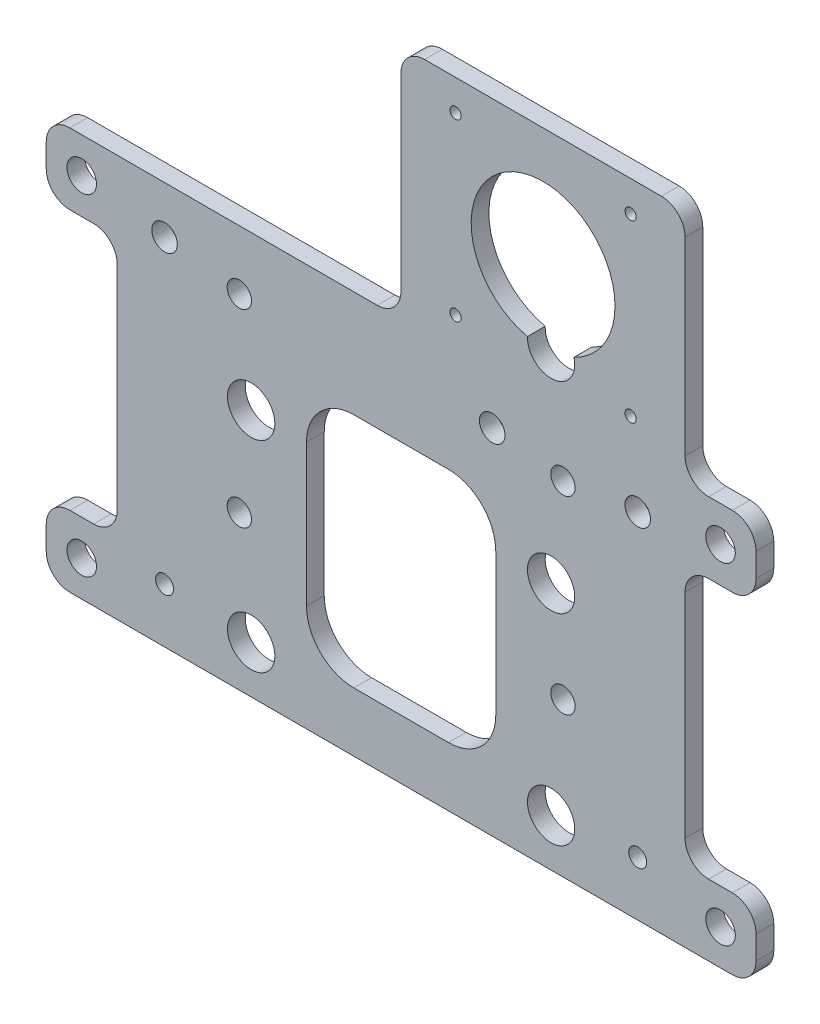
ISO-10303-21;
HEADER;
FILE_DESCRIPTION(('STEP AP214'),'2;1');
FILE_NAME('part.step','',(''),(''),'','','');
FILE_SCHEMA(('AUTOMOTIVE_DESIGN { 1 0 10303 214 1 1 1 1 }'));
ENDSEC;
DATA;
#1=APPLICATION_CONTEXT('core data for automotive mechanical design processes');
#2=APPLICATION_PROTOCOL_DEFINITION('international standard','automotive_design',2000,#1);
#3=PRODUCT_CONTEXT('',#1,'mechanical');
#4=PRODUCT('Part','Part','',(#3));
#5=PRODUCT_RELATED_PRODUCT_CATEGORY('part','',(#4));
#6=PRODUCT_DEFINITION_FORMATION('','',#4);
#7=PRODUCT_DEFINITION_CONTEXT('part definition',#1,'design');
#8=PRODUCT_DEFINITION('design','',#6,#7);
#9=PRODUCT_DEFINITION_SHAPE('','',#8);
#10=(LENGTH_UNIT() NAMED_UNIT(*) SI_UNIT(.MILLI.,.METRE.));
#11=(NAMED_UNIT(*) PLANE_ANGLE_UNIT() SI_UNIT($,.RADIAN.));
#12=(NAMED_UNIT(*) SI_UNIT($,.STERADIAN.) SOLID_ANGLE_UNIT());
#13=UNCERTAINTY_MEASURE_WITH_UNIT(LENGTH_MEASURE(1.E-05),#10,'distance_accuracy_value','');
#14=(GEOMETRIC_REPRESENTATION_CONTEXT(3) GLOBAL_UNCERTAINTY_ASSIGNED_CONTEXT((#13)) GLOBAL_UNIT_ASSIGNED_CONTEXT((#10,
#11,#12)) REPRESENTATION_CONTEXT('',''));
#15=CARTESIAN_POINT('',(0.,0.,0.));
#16=DIRECTION('',(0.,0.,1.));
#17=DIRECTION('',(1.,0.,0.));
#18=AXIS2_PLACEMENT_3D('',#15,#16,#17);
#19=CARTESIAN_POINT('',(-35.6224095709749,-93.4956796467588,4.7625));
#20=DIRECTION('',(0.,0.,1.));
#21=DIRECTION('',(1.,0.,0.));
#22=AXIS2_PLACEMENT_3D('',#19,#20,#21);
#23=PLANE('',#22);
#24=DIRECTION('',(1.,0.,0.));
#25=VECTOR('',#24,1.);
#26=CARTESIAN_POINT('',(65.9775904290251,4.9293203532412,4.7625));
#27=LINE('',#26,#25);
#28=CARTESIAN_POINT('',(27.8775904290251,4.9293203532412,4.7625));
#29=VERTEX_POINT('',#28);
#30=CARTESIAN_POINT('',(53.2775904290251,4.9293203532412,4.7625));
#31=VERTEX_POINT('',#30);
#32=EDGE_CURVE('E630',#29,#31,#27,.T.);
#33=ORIENTED_EDGE('',*,*,#32,.T.);
#34=CARTESIAN_POINT('',(53.2775904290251,-7.7706796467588,4.7625));
#35=DIRECTION('',(0.,0.,1.));
#36=DIRECTION('',(1.,0.,0.));
#37=AXIS2_PLACEMENT_3D('',#34,#35,#36);
#38=CIRCLE('',#37,12.7);
#39=CARTESIAN_POINT('',(65.9775904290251,-7.7706796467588,4.7625));
#40=VERTEX_POINT('',#39);
#41=EDGE_CURVE('E11',#31,#40,#38,.F.);
#42=ORIENTED_EDGE('',*,*,#41,.T.);
#43=DIRECTION('',(0.,-1.,0.));
#44=VECTOR('',#43,1.);
#45=CARTESIAN_POINT('',(65.9775904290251,4.9293203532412,4.7625));
#46=LINE('',#45,#44);
#47=CARTESIAN_POINT('',(65.9775904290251,-45.8706796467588,4.7625));
#48=VERTEX_POINT('',#47);
#49=EDGE_CURVE('E617',#40,#48,#46,.T.);
#50=ORIENTED_EDGE('',*,*,#49,.T.);
#51=CARTESIAN_POINT('',(53.2775904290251,-45.8706796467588,4.7625));
#52=DIRECTION('',(0.,0.,1.));
#53=DIRECTION('',(1.,0.,0.));
#54=AXIS2_PLACEMENT_3D('',#51,#52,#53);
#55=CIRCLE('',#54,12.7);
#56=CARTESIAN_POINT('',(53.2775904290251,-58.5706796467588,4.7625));
#57=VERTEX_POINT('',#56);
#58=EDGE_CURVE('E600',#48,#57,#55,.F.);
#59=ORIENTED_EDGE('',*,*,#58,.T.);
#60=DIRECTION('',(-1.,0.,0.));
#61=VECTOR('',#60,1.);
#62=CARTESIAN_POINT('',(65.9775904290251,-58.5706796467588,4.7625));
#63=LINE('',#62,#61);
#64=CARTESIAN_POINT('',(27.8775904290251,-58.5706796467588,4.7625));
#65=VERTEX_POINT('',#64);
#66=EDGE_CURVE('E622',#57,#65,#63,.T.);
#67=ORIENTED_EDGE('',*,*,#66,.T.);
#68=CARTESIAN_POINT('',(27.8775904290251,-45.8706796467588,4.7625));
#69=DIRECTION('',(0.,0.,1.));
#70=DIRECTION('',(1.,0.,0.));
#71=AXIS2_PLACEMENT_3D('',#68,#69,#70);
#72=CIRCLE('',#71,12.7);
#73=CARTESIAN_POINT('',(15.1775904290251,-45.8706796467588,4.7625));
#74=VERTEX_POINT('',#73);
#75=EDGE_CURVE('E596',#65,#74,#72,.F.);
#76=ORIENTED_EDGE('',*,*,#75,.T.);
#77=DIRECTION('',(0.,1.,0.));
#78=VECTOR('',#77,1.);
#79=CARTESIAN_POINT('',(15.1775904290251,4.9293203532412,4.7625));
#80=LINE('',#79,#78);
#81=CARTESIAN_POINT('',(15.1775904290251,-7.7706796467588,4.7625));
#82=VERTEX_POINT('',#81);
#83=EDGE_CURVE('E625',#74,#82,#80,.T.);
#84=ORIENTED_EDGE('',*,*,#83,.T.);
#85=CARTESIAN_POINT('',(27.8775904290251,-7.7706796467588,4.7625));
#86=DIRECTION('',(0.,0.,1.));
#87=DIRECTION('',(1.,0.,0.));
#88=AXIS2_PLACEMENT_3D('',#85,#86,#87);
#89=CIRCLE('',#88,12.7);
#90=EDGE_CURVE('E592',#82,#29,#89,.F.);
#91=ORIENTED_EDGE('',*,*,#90,.T.);
#92=EDGE_LOOP('',(#33,#42,#50,#59,#67,#76,#84,#91));
#93=FACE_BOUND('',#92,.T.);
#94=CARTESIAN_POINT('',(-2.84740957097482,-33.1706796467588,4.7625));
#95=DIRECTION('',(0.,0.,-1.));
#96=DIRECTION('',(-1.,0.,0.));
#97=AXIS2_PLACEMENT_3D('',#94,#95,#96);
#98=CIRCLE('',#97,3.2639);
#99=CARTESIAN_POINT('',(-6.11130957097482,-33.1706796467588,4.7625));
#100=VERTEX_POINT('',#99);
#101=EDGE_CURVE('E647',#100,#100,#98,.T.);
#102=ORIENTED_EDGE('',*,*,#101,.T.);
#103=EDGE_LOOP('',(#102));
#104=FACE_BOUND('',#103,.T.);
#105=CARTESIAN_POINT('',(0.327590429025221,-61.7456796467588,4.7625));
#106=DIRECTION('',(0.,0.,-1.));
#107=DIRECTION('',(-1.,0.,0.));
#108=AXIS2_PLACEMENT_3D('',#105,#106,#107);
#109=CIRCLE('',#108,6.35);
#110=CARTESIAN_POINT('',(-6.02240957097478,-61.7456796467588,4.7625));
#111=VERTEX_POINT('',#110);
#112=EDGE_CURVE('E659',#111,#111,#109,.T.);
#113=ORIENTED_EDGE('',*,*,#112,.T.);
#114=EDGE_LOOP('',(#113));
#115=FACE_BOUND('',#114,.T.);
#116=CARTESIAN_POINT('',(84.0025904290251,-33.1706796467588,4.7625));
#117=DIRECTION('',(0.,0.,-1.));
#118=DIRECTION('',(-1.,0.,0.));
#119=AXIS2_PLACEMENT_3D('',#116,#117,#118);
#120=CIRCLE('',#119,3.2639);
#121=CARTESIAN_POINT('',(80.7386904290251,-33.1706796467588,4.7625));
#122=VERTEX_POINT('',#121);
#123=EDGE_CURVE('E671',#122,#122,#120,.T.);
#124=ORIENTED_EDGE('',*,*,#123,.T.);
#125=EDGE_LOOP('',(#124));
#126=FACE_BOUND('',#125,.T.);
#127=CARTESIAN_POINT('',(80.8275904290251,-7.77067964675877,4.7625));
#128=DIRECTION('',(0.,0.,-1.));
#129=DIRECTION('',(-1.,0.,0.));
#130=AXIS2_PLACEMENT_3D('',#127,#128,#129);
#131=CIRCLE('',#130,6.34999999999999);
#132=CARTESIAN_POINT('',(74.4775904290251,-7.77067964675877,4.7625));
#133=VERTEX_POINT('',#132);
#134=EDGE_CURVE('E677',#133,#133,#131,.T.);
#135=ORIENTED_EDGE('',*,*,#134,.T.);
#136=EDGE_LOOP('',(#135));
#137=FACE_BOUND('',#136,.T.);
#138=CARTESIAN_POINT('',(-22.9224095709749,20.8043203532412,4.7625));
#139=DIRECTION('',(0.,0.,1.));
#140=DIRECTION('',(1.,0.,0.));
#141=AXIS2_PLACEMENT_3D('',#138,#139,#140);
#142=CIRCLE('',#141,3.429);
#143=CARTESIAN_POINT('',(-19.4934095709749,20.8043203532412,4.7625));
#144=VERTEX_POINT('',#143);
#145=EDGE_CURVE('E359',#144,#144,#142,.T.);
#146=ORIENTED_EDGE('',*,*,#145,.F.);
#147=EDGE_LOOP('',(#146));
#148=FACE_BOUND('',#147,.T.);
#149=CARTESIAN_POINT('',(104.077590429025,20.4284003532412,4.7625));
#150=DIRECTION('',(0.,0.,1.));
#151=DIRECTION('',(1.,0.,0.));
#152=AXIS2_PLACEMENT_3D('',#149,#150,#151);
#153=CIRCLE('',#152,3.429);
#154=CARTESIAN_POINT('',(107.506590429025,20.4284003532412,4.7625));
#155=VERTEX_POINT('',#154);
#156=EDGE_CURVE('E353',#155,#155,#153,.T.);
#157=ORIENTED_EDGE('',*,*,#156,.F.);
#158=EDGE_LOOP('',(#157));
#159=FACE_BOUND('',#158,.T.);
#160=CARTESIAN_POINT('',(-22.9224095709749,-59.8355996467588,4.7625));
#161=DIRECTION('',(0.,0.,1.));
#162=DIRECTION('',(1.,0.,0.));
#163=AXIS2_PLACEMENT_3D('',#160,#161,#162);
#164=CIRCLE('',#163,2.413);
#165=CARTESIAN_POINT('',(-20.5094095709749,-59.8355996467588,4.7625));
#166=VERTEX_POINT('',#165);
#167=EDGE_CURVE('E347',#166,#166,#164,.T.);
#168=ORIENTED_EDGE('',*,*,#167,.F.);
#169=EDGE_LOOP('',(#168));
#170=FACE_BOUND('',#169,.T.);
#171=CARTESIAN_POINT('',(104.077590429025,-59.8355996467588,4.7625));
#172=DIRECTION('',(0.,0.,1.));
#173=DIRECTION('',(1.,0.,0.));
#174=AXIS2_PLACEMENT_3D('',#171,#172,#173);
#175=CIRCLE('',#174,2.41299999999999);
#176=CARTESIAN_POINT('',(106.490590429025,-59.8355996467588,4.7625));
#177=VERTEX_POINT('',#176);
#178=EDGE_CURVE('E341',#177,#177,#175,.T.);
#179=ORIENTED_EDGE('',*,*,#178,.F.);
#180=EDGE_LOOP('',(#179));
#181=FACE_BOUND('',#180,.T.);
#182=CARTESIAN_POINT('',(65.0250904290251,20.4284003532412,4.7625));
#183=DIRECTION('',(0.,0.,1.));
#184=DIRECTION('',(1.,0.,0.));
#185=AXIS2_PLACEMENT_3D('',#182,#183,#184);
#186=CIRCLE('',#185,3.429);
#187=CARTESIAN_POINT('',(68.4540904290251,20.4284003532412,4.7625));
#188=VERTEX_POINT('',#187);
#189=EDGE_CURVE('E336',#188,#188,#186,.T.);
#190=ORIENTED_EDGE('',*,*,#189,.F.);
#191=EDGE_LOOP('',(#190));
#192=FACE_BOUND('',#191,.T.);
#193=DIRECTION('',(0.,1.,0.));
#194=VECTOR('',#193,1.);
#195=CARTESIAN_POINT('',(116.777590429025,33.5043203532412,4.7625));
#196=LINE('',#195,#194);
#197=CARTESIAN_POINT('',(116.777590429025,39.8543203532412,4.7625));
#198=VERTEX_POINT('',#197);
#199=CARTESIAN_POINT('',(116.777590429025,90.6543203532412,4.7625));
#200=VERTEX_POINT('',#199);
#201=EDGE_CURVE('E377',#198,#200,#196,.T.);
#202=ORIENTED_EDGE('',*,*,#201,.T.);
#203=CARTESIAN_POINT('',(110.427590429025,90.6543203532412,4.7625));
#204=DIRECTION('',(0.,0.,1.));
#205=DIRECTION('',(1.,0.,0.));
#206=AXIS2_PLACEMENT_3D('',#203,#204,#205);
#207=CIRCLE('',#206,6.35);
#208=CARTESIAN_POINT('',(110.427590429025,97.0043203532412,4.7625));
#209=VERTEX_POINT('',#208);
#210=EDGE_CURVE('E401',#200,#209,#207,.T.);
#211=ORIENTED_EDGE('',*,*,#210,.T.);
#212=DIRECTION('',(-1.,0.,0.));
#213=VECTOR('',#212,1.);
#214=CARTESIAN_POINT('',(116.777590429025,97.0043203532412,4.7625));
#215=LINE('',#214,#213);
#216=CARTESIAN_POINT('',(46.8679929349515,97.0043203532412,4.7625));
#217=VERTEX_POINT('',#216);
#218=EDGE_CURVE('E323',#209,#217,#215,.T.);
#219=ORIENTED_EDGE('',*,*,#218,.T.);
#220=CARTESIAN_POINT('',(46.8679929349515,90.6543203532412,4.7625));
#221=DIRECTION('',(0.,0.,1.));
#222=DIRECTION('',(1.,0.,0.));
#223=AXIS2_PLACEMENT_3D('',#220,#221,#222);
#224=CIRCLE('',#223,6.35);
#225=CARTESIAN_POINT('',(40.5179929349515,90.6543203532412,4.7625));
#226=VERTEX_POINT('',#225);
#227=EDGE_CURVE('E382',#217,#226,#224,.T.);
#228=ORIENTED_EDGE('',*,*,#227,.T.);
#229=DIRECTION('',(0.,-1.,0.));
#230=VECTOR('',#229,1.);
#231=CARTESIAN_POINT('',(40.5179929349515,33.5043203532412,4.7625));
#232=LINE('',#231,#230);
#233=CARTESIAN_POINT('',(40.5179929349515,39.8543203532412,4.7625));
#234=VERTEX_POINT('',#233);
#235=EDGE_CURVE('E332',#226,#234,#232,.T.);
#236=ORIENTED_EDGE('',*,*,#235,.T.);
#237=CARTESIAN_POINT('',(34.1679929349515,39.8543203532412,4.7625));
#238=DIRECTION('',(0.,0.,1.));
#239=DIRECTION('',(1.,0.,0.));
#240=AXIS2_PLACEMENT_3D('',#237,#238,#239);
#241=CIRCLE('',#240,6.35);
#242=CARTESIAN_POINT('',(34.1679929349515,33.5043203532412,4.7625));
#243=VERTEX_POINT('',#242);
#244=EDGE_CURVE('E567',#234,#243,#241,.F.);
#245=ORIENTED_EDGE('',*,*,#244,.T.);
#246=DIRECTION('',(-1.,0.,0.));
#247=VECTOR('',#246,1.);
#248=CARTESIAN_POINT('',(-35.6224095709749,33.5043203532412,4.7625));
#249=LINE('',#248,#247);
#250=CARTESIAN_POINT('',(-48.3224095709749,33.5043203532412,4.7625));
#251=VERTEX_POINT('',#250);
#252=EDGE_CURVE('E430',#243,#251,#249,.T.);
#253=ORIENTED_EDGE('',*,*,#252,.T.);
#254=CARTESIAN_POINT('',(-48.3224095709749,27.1543203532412,4.7625));
#255=DIRECTION('',(0.,0.,1.));
#256=DIRECTION('',(1.,0.,0.));
#257=AXIS2_PLACEMENT_3D('',#254,#255,#256);
#258=CIRCLE('',#257,6.35);
#259=CARTESIAN_POINT('',(-54.6724095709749,27.1543203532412,4.7625));
#260=VERTEX_POINT('',#259);
#261=EDGE_CURVE('E384',#251,#260,#258,.T.);
#262=ORIENTED_EDGE('',*,*,#261,.T.);
#263=DIRECTION('',(0.,1.,0.));
#264=VECTOR('',#263,1.);
#265=CARTESIAN_POINT('',(-54.6724095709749,33.5043203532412,4.7625));
#266=LINE('',#265,#264);
#267=CARTESIAN_POINT('',(-54.6724095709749,20.8043203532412,4.7625));
#268=VERTEX_POINT('',#267);
#269=EDGE_CURVE('E738',#268,#260,#266,.T.);
#270=ORIENTED_EDGE('',*,*,#269,.F.);
#271=CARTESIAN_POINT('',(-48.3224095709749,20.8043203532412,4.7625));
#272=DIRECTION('',(0.,0.,1.));
#273=DIRECTION('',(1.,0.,0.));
#274=AXIS2_PLACEMENT_3D('',#271,#272,#273);
#275=CIRCLE('',#274,6.35);
#276=CARTESIAN_POINT('',(-48.3224095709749,14.4543203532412,4.7625));
#277=VERTEX_POINT('',#276);
#278=EDGE_CURVE('E387',#268,#277,#275,.T.);
#279=ORIENTED_EDGE('',*,*,#278,.T.);
#280=DIRECTION('',(-1.,0.,0.));
#281=VECTOR('',#280,1.);
#282=CARTESIAN_POINT('',(-35.6224095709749,14.4543203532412,4.7625));
#283=LINE('',#282,#281);
#284=CARTESIAN_POINT('',(-41.9724095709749,14.4543203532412,4.7625));
#285=VERTEX_POINT('',#284);
#286=EDGE_CURVE('E379',#285,#277,#283,.T.);
#287=ORIENTED_EDGE('',*,*,#286,.F.);
#288=CARTESIAN_POINT('',(-41.9724095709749,8.10432035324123,4.7625));
#289=DIRECTION('',(0.,0.,1.));
#290=DIRECTION('',(1.,0.,0.));
#291=AXIS2_PLACEMENT_3D('',#288,#289,#290);
#292=CIRCLE('',#291,6.35);
#293=CARTESIAN_POINT('',(-35.6224095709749,8.10432035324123,4.7625));
#294=VERTEX_POINT('',#293);
#295=EDGE_CURVE('E561',#285,#294,#292,.F.);
#296=ORIENTED_EDGE('',*,*,#295,.T.);
#297=DIRECTION('',(0.,-1.,0.));
#298=VECTOR('',#297,1.);
#299=CARTESIAN_POINT('',(-35.6224095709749,33.5043203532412,4.7625));
#300=LINE('',#299,#298);
#301=CARTESIAN_POINT('',(-35.6224095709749,-49.0456796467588,4.7625));
#302=VERTEX_POINT('',#301);
#303=EDGE_CURVE('E373',#294,#302,#300,.T.);
#304=ORIENTED_EDGE('',*,*,#303,.T.);
#305=CARTESIAN_POINT('',(-41.9724095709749,-49.0456796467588,4.7625));
#306=DIRECTION('',(0.,0.,1.));
#307=DIRECTION('',(1.,0.,0.));
#308=AXIS2_PLACEMENT_3D('',#305,#306,#307);
#309=CIRCLE('',#308,6.35);
#310=CARTESIAN_POINT('',(-41.9724095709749,-55.3956796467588,4.7625));
#311=VERTEX_POINT('',#310);
#312=EDGE_CURVE('E565',#302,#311,#309,.F.);
#313=ORIENTED_EDGE('',*,*,#312,.T.);
#314=DIRECTION('',(1.,0.,0.));
#315=VECTOR('',#314,1.);
#316=CARTESIAN_POINT('',(-35.6224095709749,-55.3956796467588,4.7625));
#317=LINE('',#316,#315);
#318=CARTESIAN_POINT('',(-48.3224095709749,-55.3956796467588,4.7625));
#319=VERTEX_POINT('',#318);
#320=EDGE_CURVE('E726',#319,#311,#317,.T.);
#321=ORIENTED_EDGE('',*,*,#320,.F.);
#322=CARTESIAN_POINT('',(-48.3224095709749,-61.7456796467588,4.7625));
#323=DIRECTION('',(0.,0.,1.));
#324=DIRECTION('',(1.,0.,0.));
#325=AXIS2_PLACEMENT_3D('',#322,#323,#324);
#326=CIRCLE('',#325,6.35);
#327=CARTESIAN_POINT('',(-54.6724095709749,-61.7456796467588,4.7625));
#328=VERTEX_POINT('',#327);
#329=EDGE_CURVE('E389',#319,#328,#326,.T.);
#330=ORIENTED_EDGE('',*,*,#329,.T.);
#331=DIRECTION('',(0.,1.,0.));
#332=VECTOR('',#331,1.);
#333=CARTESIAN_POINT('',(-54.6724095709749,-74.4456796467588,4.7625));
#334=LINE('',#333,#332);
#335=CARTESIAN_POINT('',(-54.6724095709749,-68.0956796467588,4.7625));
#336=VERTEX_POINT('',#335);
#337=EDGE_CURVE('E723',#336,#328,#334,.T.);
#338=ORIENTED_EDGE('',*,*,#337,.F.);
#339=CARTESIAN_POINT('',(-48.3224095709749,-68.0956796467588,4.7625));
#340=DIRECTION('',(0.,0.,1.));
#341=DIRECTION('',(1.,0.,0.));
#342=AXIS2_PLACEMENT_3D('',#339,#340,#341);
#343=CIRCLE('',#342,6.35);
#344=CARTESIAN_POINT('',(-48.3224095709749,-74.4456796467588,4.7625));
#345=VERTEX_POINT('',#344);
#346=EDGE_CURVE('E391',#336,#345,#343,.T.);
#347=ORIENTED_EDGE('',*,*,#346,.T.);
#348=DIRECTION('',(-1.,0.,0.));
#349=VECTOR('',#348,1.);
#350=CARTESIAN_POINT('',(-35.6224095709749,-74.4456796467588,4.7625));
#351=LINE('',#350,#349);
#352=CARTESIAN_POINT('',(129.477590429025,-74.4456796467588,4.7625));
#353=VERTEX_POINT('',#352);
#354=EDGE_CURVE('E321',#353,#345,#351,.T.);
#355=ORIENTED_EDGE('',*,*,#354,.F.);
#356=CARTESIAN_POINT('',(129.477590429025,-68.0956796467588,4.7625));
#357=DIRECTION('',(0.,0.,1.));
#358=DIRECTION('',(1.,0.,0.));
#359=AXIS2_PLACEMENT_3D('',#356,#357,#358);
#360=CIRCLE('',#359,6.35);
#361=CARTESIAN_POINT('',(135.827590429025,-68.0956796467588,4.7625));
#362=VERTEX_POINT('',#361);
#363=EDGE_CURVE('E393',#353,#362,#360,.T.);
#364=ORIENTED_EDGE('',*,*,#363,.T.);
#365=DIRECTION('',(0.,-1.,0.));
#366=VECTOR('',#365,1.);
#367=CARTESIAN_POINT('',(135.827590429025,-74.4456796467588,4.7625));
#368=LINE('',#367,#366);
#369=CARTESIAN_POINT('',(135.827590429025,-61.7456796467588,4.7625));
#370=VERTEX_POINT('',#369);
#371=EDGE_CURVE('E716',#370,#362,#368,.T.);
#372=ORIENTED_EDGE('',*,*,#371,.F.);
#373=CARTESIAN_POINT('',(129.477590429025,-61.7456796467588,4.7625));
#374=DIRECTION('',(0.,0.,1.));
#375=DIRECTION('',(1.,0.,0.));
#376=AXIS2_PLACEMENT_3D('',#373,#374,#375);
#377=CIRCLE('',#376,6.35);
#378=CARTESIAN_POINT('',(129.477590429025,-55.3956796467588,4.7625));
#379=VERTEX_POINT('',#378);
#380=EDGE_CURVE('E395',#370,#379,#377,.T.);
#381=ORIENTED_EDGE('',*,*,#380,.T.);
#382=DIRECTION('',(1.,0.,0.));
#383=VECTOR('',#382,1.);
#384=CARTESIAN_POINT('',(116.777590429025,-55.3956796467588,4.7625));
#385=LINE('',#384,#383);
#386=CARTESIAN_POINT('',(123.127590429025,-55.3956796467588,4.7625));
#387=VERTEX_POINT('',#386);
#388=EDGE_CURVE('E710',#387,#379,#385,.T.);
#389=ORIENTED_EDGE('',*,*,#388,.F.);
#390=CARTESIAN_POINT('',(123.127590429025,-49.0456796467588,4.7625));
#391=DIRECTION('',(0.,0.,1.));
#392=DIRECTION('',(1.,0.,0.));
#393=AXIS2_PLACEMENT_3D('',#390,#391,#392);
#394=CIRCLE('',#393,6.35);
#395=CARTESIAN_POINT('',(116.777590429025,-49.0456796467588,4.7625));
#396=VERTEX_POINT('',#395);
#397=EDGE_CURVE('E557',#387,#396,#394,.F.);
#398=ORIENTED_EDGE('',*,*,#397,.T.);
#399=CARTESIAN_POINT('',(116.777590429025,8.10432035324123,4.7625));
#400=VERTEX_POINT('',#399);
#401=EDGE_CURVE('E433',#396,#400,#196,.T.);
#402=ORIENTED_EDGE('',*,*,#401,.T.);
#403=CARTESIAN_POINT('',(123.127590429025,8.10432035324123,4.7625));
#404=DIRECTION('',(0.,0.,1.));
#405=DIRECTION('',(1.,0.,0.));
#406=AXIS2_PLACEMENT_3D('',#403,#404,#405);
#407=CIRCLE('',#406,6.35);
#408=CARTESIAN_POINT('',(123.127590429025,14.4543203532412,4.7625));
#409=VERTEX_POINT('',#408);
#410=EDGE_CURVE('E553',#400,#409,#407,.F.);
#411=ORIENTED_EDGE('',*,*,#410,.T.);
#412=DIRECTION('',(-1.,0.,0.));
#413=VECTOR('',#412,1.);
#414=CARTESIAN_POINT('',(116.777590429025,14.4543203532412,4.7625));
#415=LINE('',#414,#413);
#416=CARTESIAN_POINT('',(129.477590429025,14.4543203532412,4.7625));
#417=VERTEX_POINT('',#416);
#418=EDGE_CURVE('E436',#417,#409,#415,.T.);
#419=ORIENTED_EDGE('',*,*,#418,.F.);
#420=CARTESIAN_POINT('',(129.477590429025,20.8043203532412,4.7625));
#421=DIRECTION('',(0.,0.,1.));
#422=DIRECTION('',(1.,0.,0.));
#423=AXIS2_PLACEMENT_3D('',#420,#421,#422);
#424=CIRCLE('',#423,6.35);
#425=CARTESIAN_POINT('',(135.827590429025,20.8043203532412,4.7625));
#426=VERTEX_POINT('',#425);
#427=EDGE_CURVE('E397',#417,#426,#424,.T.);
#428=ORIENTED_EDGE('',*,*,#427,.T.);
#429=DIRECTION('',(0.,-1.,0.));
#430=VECTOR('',#429,1.);
#431=CARTESIAN_POINT('',(135.827590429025,33.5043203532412,4.7625));
#432=LINE('',#431,#430);
#433=CARTESIAN_POINT('',(135.827590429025,27.1543203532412,4.7625));
#434=VERTEX_POINT('',#433);
#435=EDGE_CURVE('E441',#434,#426,#432,.T.);
#436=ORIENTED_EDGE('',*,*,#435,.F.);
#437=CARTESIAN_POINT('',(129.477590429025,27.1543203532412,4.7625));
#438=DIRECTION('',(0.,0.,1.));
#439=DIRECTION('',(1.,0.,0.));
#440=AXIS2_PLACEMENT_3D('',#437,#438,#439);
#441=CIRCLE('',#440,6.35);
#442=CARTESIAN_POINT('',(129.477590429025,33.5043203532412,4.7625));
#443=VERTEX_POINT('',#442);
#444=EDGE_CURVE('E399',#434,#443,#441,.T.);
#445=ORIENTED_EDGE('',*,*,#444,.T.);
#446=DIRECTION('',(1.,0.,0.));
#447=VECTOR('',#446,1.);
#448=CARTESIAN_POINT('',(116.777590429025,33.5043203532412,4.7625));
#449=LINE('',#448,#447);
#450=CARTESIAN_POINT('',(123.127590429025,33.5043203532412,4.7625));
#451=VERTEX_POINT('',#450);
#452=EDGE_CURVE('E442',#451,#443,#449,.T.);
#453=ORIENTED_EDGE('',*,*,#452,.F.);
#454=CARTESIAN_POINT('',(123.127590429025,39.8543203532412,4.7625));
#455=DIRECTION('',(0.,0.,1.));
#456=DIRECTION('',(1.,0.,0.));
#457=AXIS2_PLACEMENT_3D('',#454,#455,#456);
#458=CIRCLE('',#457,6.35);
#459=EDGE_CURVE('E549',#451,#198,#458,.F.);
#460=ORIENTED_EDGE('',*,*,#459,.T.);
#461=EDGE_LOOP('',(#202,#211,#219,#228,#236,#245,#253,#262,#270,#279,#287,#296,#304,#313,#321,
#330,#338,#347,#355,#364,#372,#381,#389,#398,#402,#411,#419,#428,#436,#445,#453,#460));
#462=FACE_BOUND('',#461,.T.);
#463=CARTESIAN_POINT('',(55.1825904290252,88.7493203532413,4.7625));
#464=DIRECTION('',(0.,0.,1.));
#465=DIRECTION('',(1.,0.,0.));
#466=AXIS2_PLACEMENT_3D('',#463,#464,#465);
#467=CIRCLE('',#466,1.5);
#468=CARTESIAN_POINT('',(56.6825904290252,88.7493203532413,4.7625));
#469=VERTEX_POINT('',#468);
#470=EDGE_CURVE('E753',#469,#469,#467,.T.);
#471=ORIENTED_EDGE('',*,*,#470,.F.);
#472=EDGE_LOOP('',(#471));
#473=FACE_BOUND('',#472,.T.);
#474=CARTESIAN_POINT('',(55.1825904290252,41.7593203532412,4.7625));
#475=DIRECTION('',(0.,0.,1.));
#476=DIRECTION('',(1.,0.,0.));
#477=AXIS2_PLACEMENT_3D('',#474,#475,#476);
#478=CIRCLE('',#477,1.5);
#479=CARTESIAN_POINT('',(56.6825904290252,41.7593203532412,4.7625));
#480=VERTEX_POINT('',#479);
#481=EDGE_CURVE('E749',#480,#480,#478,.T.);
#482=ORIENTED_EDGE('',*,*,#481,.F.);
#483=EDGE_LOOP('',(#482));
#484=FACE_BOUND('',#483,.T.);
#485=CARTESIAN_POINT('',(102.172590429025,88.7493203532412,4.7625));
#486=DIRECTION('',(0.,0.,1.));
#487=DIRECTION('',(1.,0.,0.));
#488=AXIS2_PLACEMENT_3D('',#485,#486,#487);
#489=CIRCLE('',#488,1.50000000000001);
#490=CARTESIAN_POINT('',(103.672590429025,88.7493203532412,4.7625));
#491=VERTEX_POINT('',#490);
#492=EDGE_CURVE('E745',#491,#491,#489,.T.);
#493=ORIENTED_EDGE('',*,*,#492,.F.);
#494=EDGE_LOOP('',(#493));
#495=FACE_BOUND('',#494,.T.);
#496=CARTESIAN_POINT('',(102.172590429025,41.7593203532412,4.7625));
#497=DIRECTION('',(0.,0.,1.));
#498=DIRECTION('',(1.,0.,0.));
#499=AXIS2_PLACEMENT_3D('',#496,#497,#498);
#500=CIRCLE('',#499,1.50000000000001);
#501=CARTESIAN_POINT('',(103.672590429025,41.7593203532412,4.7625));
#502=VERTEX_POINT('',#501);
#503=EDGE_CURVE('E741',#502,#502,#500,.T.);
#504=ORIENTED_EDGE('',*,*,#503,.F.);
#505=EDGE_LOOP('',(#504));
#506=FACE_BOUND('',#505,.T.);
#507=CARTESIAN_POINT('',(-45.1474095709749,23.9793203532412,4.7625));
#508=DIRECTION('',(0.,0.,1.));
#509=DIRECTION('',(1.,0.,0.));
#510=AXIS2_PLACEMENT_3D('',#507,#508,#509);
#511=CIRCLE('',#510,3.96874999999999);
#512=CARTESIAN_POINT('',(-41.1786595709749,23.9793203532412,4.7625));
#513=VERTEX_POINT('',#512);
#514=EDGE_CURVE('E450',#513,#513,#511,.T.);
#515=ORIENTED_EDGE('',*,*,#514,.F.);
#516=EDGE_LOOP('',(#515));
#517=FACE_BOUND('',#516,.T.);
#518=CARTESIAN_POINT('',(126.302590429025,23.9793203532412,4.7625));
#519=DIRECTION('',(0.,0.,1.));
#520=DIRECTION('',(1.,0.,0.));
#521=AXIS2_PLACEMENT_3D('',#518,#519,#520);
#522=CIRCLE('',#521,3.96874999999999);
#523=CARTESIAN_POINT('',(130.271340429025,23.9793203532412,4.7625));
#524=VERTEX_POINT('',#523);
#525=EDGE_CURVE('E701',#524,#524,#522,.T.);
#526=ORIENTED_EDGE('',*,*,#525,.F.);
#527=EDGE_LOOP('',(#526));
#528=FACE_BOUND('',#527,.T.);
#529=CARTESIAN_POINT('',(-45.1474095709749,-64.9206796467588,4.7625));
#530=DIRECTION('',(0.,0.,1.));
#531=DIRECTION('',(1.,0.,0.));
#532=AXIS2_PLACEMENT_3D('',#529,#530,#531);
#533=CIRCLE('',#532,3.96874999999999);
#534=CARTESIAN_POINT('',(-41.1786595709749,-64.9206796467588,4.7625));
#535=VERTEX_POINT('',#534);
#536=EDGE_CURVE('E695',#535,#535,#533,.T.);
#537=ORIENTED_EDGE('',*,*,#536,.F.);
#538=EDGE_LOOP('',(#537));
#539=FACE_BOUND('',#538,.T.);
#540=CARTESIAN_POINT('',(126.302590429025,-64.9206796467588,4.7625));
#541=DIRECTION('',(0.,0.,1.));
#542=DIRECTION('',(1.,0.,0.));
#543=AXIS2_PLACEMENT_3D('',#540,#541,#542);
#544=CIRCLE('',#543,3.96874999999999);
#545=CARTESIAN_POINT('',(130.271340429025,-64.9206796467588,4.7625));
#546=VERTEX_POINT('',#545);
#547=EDGE_CURVE('E689',#546,#546,#544,.T.);
#548=ORIENTED_EDGE('',*,*,#547,.F.);
#549=EDGE_LOOP('',(#548));
#550=FACE_BOUND('',#549,.T.);
#551=CARTESIAN_POINT('',(80.8275904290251,-61.7456796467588,4.7625));
#552=DIRECTION('',(0.,0.,-1.));
#553=DIRECTION('',(-1.,0.,0.));
#554=AXIS2_PLACEMENT_3D('',#551,#552,#553);
#555=CIRCLE('',#554,6.34999999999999);
#556=CARTESIAN_POINT('',(74.4775904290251,-61.7456796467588,4.7625));
#557=VERTEX_POINT('',#556);
#558=EDGE_CURVE('E683',#557,#557,#555,.T.);
#559=ORIENTED_EDGE('',*,*,#558,.T.);
#560=EDGE_LOOP('',(#559));
#561=FACE_BOUND('',#560,.T.);
#562=CARTESIAN_POINT('',(78.6775904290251,65.2543203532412,4.7625));
#563=DIRECTION('',(0.,0.,1.));
#564=DIRECTION('',(1.,0.,0.));
#565=AXIS2_PLACEMENT_3D('',#562,#563,#564);
#566=CIRCLE('',#565,19.304);
#567=CARTESIAN_POINT('',(86.9682573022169,47.8213269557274,4.7625));
#568=VERTEX_POINT('',#567);
#569=CARTESIAN_POINT('',(74.4809875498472,46.4120025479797,4.7625));
#570=VERTEX_POINT('',#569);
#571=EDGE_CURVE('E316',#568,#570,#566,.T.);
#572=ORIENTED_EDGE('',*,*,#571,.F.);
#573=CARTESIAN_POINT('',(80.8275904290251,46.2043203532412,4.7625));
#574=DIRECTION('',(0.,0.,-1.));
#575=DIRECTION('',(-1.,0.,0.));
#576=AXIS2_PLACEMENT_3D('',#573,#574,#575);
#577=CIRCLE('',#576,6.34999999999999);
#578=EDGE_CURVE('E302',#568,#570,#577,.T.);
#579=ORIENTED_EDGE('',*,*,#578,.T.);
#580=EDGE_LOOP('',(#572,#579));
#581=FACE_BOUND('',#580,.T.);
#582=CARTESIAN_POINT('',(84.0025904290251,17.6293203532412,4.7625));
#583=DIRECTION('',(0.,0.,-1.));
#584=DIRECTION('',(-1.,0.,0.));
#585=AXIS2_PLACEMENT_3D('',#582,#583,#584);
#586=CIRCLE('',#585,3.2639);
#587=CARTESIAN_POINT('',(80.7386904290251,17.6293203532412,4.7625));
#588=VERTEX_POINT('',#587);
#589=EDGE_CURVE('E665',#588,#588,#586,.T.);
#590=ORIENTED_EDGE('',*,*,#589,.T.);
#591=EDGE_LOOP('',(#590));
#592=FACE_BOUND('',#591,.T.);
#593=CARTESIAN_POINT('',(0.327590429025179,-7.77067964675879,4.7625));
#594=DIRECTION('',(0.,0.,-1.));
#595=DIRECTION('',(-1.,0.,0.));
#596=AXIS2_PLACEMENT_3D('',#593,#594,#595);
#597=CIRCLE('',#596,6.35);
#598=CARTESIAN_POINT('',(-6.02240957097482,-7.77067964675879,4.7625));
#599=VERTEX_POINT('',#598);
#600=EDGE_CURVE('E653',#599,#599,#597,.T.);
#601=ORIENTED_EDGE('',*,*,#600,.T.);
#602=EDGE_LOOP('',(#601));
#603=FACE_BOUND('',#602,.T.);
#604=CARTESIAN_POINT('',(-2.84740957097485,17.6293203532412,4.7625));
#605=DIRECTION('',(0.,0.,-1.));
#606=DIRECTION('',(-1.,0.,0.));
#607=AXIS2_PLACEMENT_3D('',#604,#605,#606);
#608=CIRCLE('',#607,3.2639);
#609=CARTESIAN_POINT('',(-6.11130957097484,17.6293203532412,4.7625));
#610=VERTEX_POINT('',#609);
#611=EDGE_CURVE('E641',#610,#610,#608,.T.);
#612=ORIENTED_EDGE('',*,*,#611,.T.);
#613=EDGE_LOOP('',(#612));
#614=FACE_BOUND('',#613,.T.);
#615=ADVANCED_FACE('F31',(#93,#104,#115,#126,#137,#148,#159,#170,#181,#192,#462,#473,#484,#495,
#506,#517,#528,#539,#550,#561,#581,#592,#603,#614),#23,.T.);
#616=CARTESIAN_POINT('',(-35.6224095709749,-93.4956796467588,0.));
#617=DIRECTION('',(0.,0.,1.));
#618=DIRECTION('',(1.,0.,0.));
#619=AXIS2_PLACEMENT_3D('',#616,#617,#618);
#620=PLANE('',#619);
#621=DIRECTION('',(-1.,0.,0.));
#622=VECTOR('',#621,1.);
#623=CARTESIAN_POINT('',(65.9775904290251,-58.5706796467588,0.));
#624=LINE('',#623,#622);
#625=CARTESIAN_POINT('',(53.2775904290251,-58.5706796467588,0.));
#626=VERTEX_POINT('',#625);
#627=CARTESIAN_POINT('',(27.8775904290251,-58.5706796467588,0.));
#628=VERTEX_POINT('',#627);
#629=EDGE_CURVE('E634',#626,#628,#624,.T.);
#630=ORIENTED_EDGE('',*,*,#629,.F.);
#631=CARTESIAN_POINT('',(53.2775904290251,-45.8706796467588,0.));
#632=DIRECTION('',(0.,0.,1.));
#633=DIRECTION('',(1.,0.,0.));
#634=AXIS2_PLACEMENT_3D('',#631,#632,#633);
#635=CIRCLE('',#634,12.7);
#636=CARTESIAN_POINT('',(65.9775904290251,-45.8706796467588,0.));
#637=VERTEX_POINT('',#636);
#638=EDGE_CURVE('E598',#626,#637,#635,.T.);
#639=ORIENTED_EDGE('',*,*,#638,.T.);
#640=DIRECTION('',(0.,-1.,0.));
#641=VECTOR('',#640,1.);
#642=CARTESIAN_POINT('',(65.9775904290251,4.9293203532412,0.));
#643=LINE('',#642,#641);
#644=CARTESIAN_POINT('',(65.9775904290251,-7.7706796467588,0.));
#645=VERTEX_POINT('',#644);
#646=EDGE_CURVE('E609',#645,#637,#643,.T.);
#647=ORIENTED_EDGE('',*,*,#646,.F.);
#648=CARTESIAN_POINT('',(53.2775904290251,-7.7706796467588,0.));
#649=DIRECTION('',(0.,0.,1.));
#650=DIRECTION('',(1.,0.,0.));
#651=AXIS2_PLACEMENT_3D('',#648,#649,#650);
#652=CIRCLE('',#651,12.7);
#653=CARTESIAN_POINT('',(53.2775904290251,4.9293203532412,0.));
#654=VERTEX_POINT('',#653);
#655=EDGE_CURVE('E39',#645,#654,#652,.T.);
#656=ORIENTED_EDGE('',*,*,#655,.T.);
#657=DIRECTION('',(1.,0.,0.));
#658=VECTOR('',#657,1.);
#659=CARTESIAN_POINT('',(65.9775904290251,4.9293203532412,0.));
#660=LINE('',#659,#658);
#661=CARTESIAN_POINT('',(27.8775904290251,4.9293203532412,0.));
#662=VERTEX_POINT('',#661);
#663=EDGE_CURVE('E608',#662,#654,#660,.T.);
#664=ORIENTED_EDGE('',*,*,#663,.F.);
#665=CARTESIAN_POINT('',(27.8775904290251,-7.7706796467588,0.));
#666=DIRECTION('',(0.,0.,1.));
#667=DIRECTION('',(1.,0.,0.));
#668=AXIS2_PLACEMENT_3D('',#665,#666,#667);
#669=CIRCLE('',#668,12.7);
#670=CARTESIAN_POINT('',(15.1775904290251,-7.7706796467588,0.));
#671=VERTEX_POINT('',#670);
#672=EDGE_CURVE('E590',#662,#671,#669,.T.);
#673=ORIENTED_EDGE('',*,*,#672,.T.);
#674=DIRECTION('',(0.,1.,0.));
#675=VECTOR('',#674,1.);
#676=CARTESIAN_POINT('',(15.1775904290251,4.9293203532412,0.));
#677=LINE('',#676,#675);
#678=CARTESIAN_POINT('',(15.1775904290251,-45.8706796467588,0.));
#679=VERTEX_POINT('',#678);
#680=EDGE_CURVE('E618',#679,#671,#677,.T.);
#681=ORIENTED_EDGE('',*,*,#680,.F.);
#682=CARTESIAN_POINT('',(27.8775904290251,-45.8706796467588,0.));
#683=DIRECTION('',(0.,0.,1.));
#684=DIRECTION('',(1.,0.,0.));
#685=AXIS2_PLACEMENT_3D('',#682,#683,#684);
#686=CIRCLE('',#685,12.7);
#687=EDGE_CURVE('E594',#679,#628,#686,.T.);
#688=ORIENTED_EDGE('',*,*,#687,.T.);
#689=EDGE_LOOP('',(#630,#639,#647,#656,#664,#673,#681,#688));
#690=FACE_BOUND('',#689,.T.);
#691=CARTESIAN_POINT('',(-2.84740957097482,-33.1706796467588,0.));
#692=DIRECTION('',(0.,0.,-1.));
#693=DIRECTION('',(-1.,0.,0.));
#694=AXIS2_PLACEMENT_3D('',#691,#692,#693);
#695=CIRCLE('',#694,3.26389999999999);
#696=CARTESIAN_POINT('',(-6.11130957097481,-33.1706796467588,0.));
#697=VERTEX_POINT('',#696);
#698=EDGE_CURVE('E644',#697,#697,#695,.T.);
#699=ORIENTED_EDGE('',*,*,#698,.F.);
#700=EDGE_LOOP('',(#699));
#701=FACE_BOUND('',#700,.T.);
#702=CARTESIAN_POINT('',(0.327590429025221,-61.7456796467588,0.));
#703=DIRECTION('',(0.,0.,-1.));
#704=DIRECTION('',(-1.,0.,0.));
#705=AXIS2_PLACEMENT_3D('',#702,#703,#704);
#706=CIRCLE('',#705,6.35);
#707=CARTESIAN_POINT('',(-6.02240957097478,-61.7456796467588,0.));
#708=VERTEX_POINT('',#707);
#709=EDGE_CURVE('E656',#708,#708,#706,.T.);
#710=ORIENTED_EDGE('',*,*,#709,.F.);
#711=EDGE_LOOP('',(#710));
#712=FACE_BOUND('',#711,.T.);
#713=CARTESIAN_POINT('',(84.0025904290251,-33.1706796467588,0.));
#714=DIRECTION('',(0.,0.,-1.));
#715=DIRECTION('',(-1.,0.,0.));
#716=AXIS2_PLACEMENT_3D('',#713,#714,#715);
#717=CIRCLE('',#716,3.26389999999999);
#718=CARTESIAN_POINT('',(80.7386904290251,-33.1706796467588,0.));
#719=VERTEX_POINT('',#718);
#720=EDGE_CURVE('E668',#719,#719,#717,.T.);
#721=ORIENTED_EDGE('',*,*,#720,.F.);
#722=EDGE_LOOP('',(#721));
#723=FACE_BOUND('',#722,.T.);
#724=CARTESIAN_POINT('',(80.8275904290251,-7.77067964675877,0.));
#725=DIRECTION('',(0.,0.,-1.));
#726=DIRECTION('',(-1.,0.,0.));
#727=AXIS2_PLACEMENT_3D('',#724,#725,#726);
#728=CIRCLE('',#727,6.34999999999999);
#729=CARTESIAN_POINT('',(74.4775904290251,-7.77067964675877,0.));
#730=VERTEX_POINT('',#729);
#731=EDGE_CURVE('E317',#730,#730,#728,.T.);
#732=ORIENTED_EDGE('',*,*,#731,.F.);
#733=EDGE_LOOP('',(#732));
#734=FACE_BOUND('',#733,.T.);
#735=DIRECTION('',(1.,0.,0.));
#736=VECTOR('',#735,1.);
#737=CARTESIAN_POINT('',(116.777590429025,97.0043203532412,0.));
#738=LINE('',#737,#736);
#739=CARTESIAN_POINT('',(46.8679929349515,97.0043203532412,0.));
#740=VERTEX_POINT('',#739);
#741=CARTESIAN_POINT('',(110.427590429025,97.0043203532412,0.));
#742=VERTEX_POINT('',#741);
#743=EDGE_CURVE('E333',#740,#742,#738,.T.);
#744=ORIENTED_EDGE('',*,*,#743,.T.);
#745=CARTESIAN_POINT('',(110.427590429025,90.6543203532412,0.));
#746=DIRECTION('',(0.,0.,1.));
#747=DIRECTION('',(1.,0.,0.));
#748=AXIS2_PLACEMENT_3D('',#745,#746,#747);
#749=CIRCLE('',#748,6.35);
#750=CARTESIAN_POINT('',(116.777590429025,90.6543203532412,0.));
#751=VERTEX_POINT('',#750);
#752=EDGE_CURVE('E476',#742,#751,#749,.F.);
#753=ORIENTED_EDGE('',*,*,#752,.T.);
#754=DIRECTION('',(0.,1.,0.));
#755=VECTOR('',#754,1.);
#756=CARTESIAN_POINT('',(116.777590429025,33.5043203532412,0.));
#757=LINE('',#756,#755);
#758=CARTESIAN_POINT('',(116.777590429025,39.8543203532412,0.));
#759=VERTEX_POINT('',#758);
#760=EDGE_CURVE('E413',#759,#751,#757,.T.);
#761=ORIENTED_EDGE('',*,*,#760,.F.);
#762=CARTESIAN_POINT('',(123.127590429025,39.8543203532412,0.));
#763=DIRECTION('',(0.,0.,1.));
#764=DIRECTION('',(1.,0.,0.));
#765=AXIS2_PLACEMENT_3D('',#762,#763,#764);
#766=CIRCLE('',#765,6.35);
#767=CARTESIAN_POINT('',(123.127590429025,33.5043203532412,0.));
#768=VERTEX_POINT('',#767);
#769=EDGE_CURVE('E547',#759,#768,#766,.T.);
#770=ORIENTED_EDGE('',*,*,#769,.T.);
#771=DIRECTION('',(1.,0.,0.));
#772=VECTOR('',#771,1.);
#773=CARTESIAN_POINT('',(116.777590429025,33.5043203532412,0.));
#774=LINE('',#773,#772);
#775=CARTESIAN_POINT('',(129.477590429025,33.5043203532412,0.));
#776=VERTEX_POINT('',#775);
#777=EDGE_CURVE('E457',#768,#776,#774,.T.);
#778=ORIENTED_EDGE('',*,*,#777,.T.);
#779=CARTESIAN_POINT('',(129.477590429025,27.1543203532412,0.));
#780=DIRECTION('',(0.,0.,1.));
#781=DIRECTION('',(1.,0.,0.));
#782=AXIS2_PLACEMENT_3D('',#779,#780,#781);
#783=CIRCLE('',#782,6.35);
#784=CARTESIAN_POINT('',(135.827590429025,27.1543203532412,0.));
#785=VERTEX_POINT('',#784);
#786=EDGE_CURVE('E474',#776,#785,#783,.F.);
#787=ORIENTED_EDGE('',*,*,#786,.T.);
#788=DIRECTION('',(0.,-1.,0.));
#789=VECTOR('',#788,1.);
#790=CARTESIAN_POINT('',(135.827590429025,33.5043203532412,0.));
#791=LINE('',#790,#789);
#792=CARTESIAN_POINT('',(135.827590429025,20.8043203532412,0.));
#793=VERTEX_POINT('',#792);
#794=EDGE_CURVE('E456',#785,#793,#791,.T.);
#795=ORIENTED_EDGE('',*,*,#794,.T.);
#796=CARTESIAN_POINT('',(129.477590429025,20.8043203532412,0.));
#797=DIRECTION('',(0.,0.,1.));
#798=DIRECTION('',(1.,0.,0.));
#799=AXIS2_PLACEMENT_3D('',#796,#797,#798);
#800=CIRCLE('',#799,6.35);
#801=CARTESIAN_POINT('',(129.477590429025,14.4543203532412,0.));
#802=VERTEX_POINT('',#801);
#803=EDGE_CURVE('E472',#793,#802,#800,.F.);
#804=ORIENTED_EDGE('',*,*,#803,.T.);
#805=DIRECTION('',(-1.,0.,0.));
#806=VECTOR('',#805,1.);
#807=CARTESIAN_POINT('',(116.777590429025,14.4543203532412,0.));
#808=LINE('',#807,#806);
#809=CARTESIAN_POINT('',(123.127590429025,14.4543203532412,0.));
#810=VERTEX_POINT('',#809);
#811=EDGE_CURVE('E452',#802,#810,#808,.T.);
#812=ORIENTED_EDGE('',*,*,#811,.T.);
#813=CARTESIAN_POINT('',(123.127590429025,8.10432035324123,0.));
#814=DIRECTION('',(0.,0.,1.));
#815=DIRECTION('',(1.,0.,0.));
#816=AXIS2_PLACEMENT_3D('',#813,#814,#815);
#817=CIRCLE('',#816,6.35);
#818=CARTESIAN_POINT('',(116.777590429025,8.10432035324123,0.));
#819=VERTEX_POINT('',#818);
#820=EDGE_CURVE('E551',#810,#819,#817,.T.);
#821=ORIENTED_EDGE('',*,*,#820,.T.);
#822=CARTESIAN_POINT('',(116.777590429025,-49.0456796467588,0.));
#823=VERTEX_POINT('',#822);
#824=EDGE_CURVE('E409',#823,#819,#757,.T.);
#825=ORIENTED_EDGE('',*,*,#824,.F.);
#826=CARTESIAN_POINT('',(123.127590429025,-49.0456796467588,0.));
#827=DIRECTION('',(0.,0.,1.));
#828=DIRECTION('',(1.,0.,0.));
#829=AXIS2_PLACEMENT_3D('',#826,#827,#828);
#830=CIRCLE('',#829,6.35);
#831=CARTESIAN_POINT('',(123.127590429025,-55.3956796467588,0.));
#832=VERTEX_POINT('',#831);
#833=EDGE_CURVE('E555',#823,#832,#830,.T.);
#834=ORIENTED_EDGE('',*,*,#833,.T.);
#835=DIRECTION('',(1.,0.,0.));
#836=VECTOR('',#835,1.);
#837=CARTESIAN_POINT('',(116.777590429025,-55.3956796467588,0.));
#838=LINE('',#837,#836);
#839=CARTESIAN_POINT('',(129.477590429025,-55.3956796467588,0.));
#840=VERTEX_POINT('',#839);
#841=EDGE_CURVE('E711',#832,#840,#838,.T.);
#842=ORIENTED_EDGE('',*,*,#841,.T.);
#843=CARTESIAN_POINT('',(129.477590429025,-61.7456796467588,0.));
#844=DIRECTION('',(0.,0.,1.));
#845=DIRECTION('',(1.,0.,0.));
#846=AXIS2_PLACEMENT_3D('',#843,#844,#845);
#847=CIRCLE('',#846,6.35);
#848=CARTESIAN_POINT('',(135.827590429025,-61.7456796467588,0.));
#849=VERTEX_POINT('',#848);
#850=EDGE_CURVE('E470',#840,#849,#847,.F.);
#851=ORIENTED_EDGE('',*,*,#850,.T.);
#852=DIRECTION('',(0.,-1.,0.));
#853=VECTOR('',#852,1.);
#854=CARTESIAN_POINT('',(135.827590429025,-74.4456796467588,0.));
#855=LINE('',#854,#853);
#856=CARTESIAN_POINT('',(135.827590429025,-68.0956796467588,0.));
#857=VERTEX_POINT('',#856);
#858=EDGE_CURVE('E707',#849,#857,#855,.T.);
#859=ORIENTED_EDGE('',*,*,#858,.T.);
#860=CARTESIAN_POINT('',(129.477590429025,-68.0956796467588,0.));
#861=DIRECTION('',(0.,0.,1.));
#862=DIRECTION('',(1.,0.,0.));
#863=AXIS2_PLACEMENT_3D('',#860,#861,#862);
#864=CIRCLE('',#863,6.35);
#865=CARTESIAN_POINT('',(129.477590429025,-74.4456796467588,0.));
#866=VERTEX_POINT('',#865);
#867=EDGE_CURVE('E468',#857,#866,#864,.F.);
#868=ORIENTED_EDGE('',*,*,#867,.T.);
#869=DIRECTION('',(1.,0.,0.));
#870=VECTOR('',#869,1.);
#871=CARTESIAN_POINT('',(116.777590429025,-74.4456796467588,0.));
#872=LINE('',#871,#870);
#873=CARTESIAN_POINT('',(-48.3224095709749,-74.4456796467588,0.));
#874=VERTEX_POINT('',#873);
#875=EDGE_CURVE('E326',#874,#866,#872,.T.);
#876=ORIENTED_EDGE('',*,*,#875,.F.);
#877=CARTESIAN_POINT('',(-48.3224095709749,-68.0956796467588,0.));
#878=DIRECTION('',(0.,0.,1.));
#879=DIRECTION('',(1.,0.,0.));
#880=AXIS2_PLACEMENT_3D('',#877,#878,#879);
#881=CIRCLE('',#880,6.35);
#882=CARTESIAN_POINT('',(-54.6724095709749,-68.0956796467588,0.));
#883=VERTEX_POINT('',#882);
#884=EDGE_CURVE('E466',#874,#883,#881,.F.);
#885=ORIENTED_EDGE('',*,*,#884,.T.);
#886=DIRECTION('',(0.,1.,0.));
#887=VECTOR('',#886,1.);
#888=CARTESIAN_POINT('',(-54.6724095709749,-74.4456796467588,0.));
#889=LINE('',#888,#887);
#890=CARTESIAN_POINT('',(-54.6724095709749,-61.7456796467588,0.));
#891=VERTEX_POINT('',#890);
#892=EDGE_CURVE('E719',#883,#891,#889,.T.);
#893=ORIENTED_EDGE('',*,*,#892,.T.);
#894=CARTESIAN_POINT('',(-48.3224095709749,-61.7456796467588,0.));
#895=DIRECTION('',(0.,0.,1.));
#896=DIRECTION('',(1.,0.,0.));
#897=AXIS2_PLACEMENT_3D('',#894,#895,#896);
#898=CIRCLE('',#897,6.35);
#899=CARTESIAN_POINT('',(-48.3224095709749,-55.3956796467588,0.));
#900=VERTEX_POINT('',#899);
#901=EDGE_CURVE('E464',#891,#900,#898,.F.);
#902=ORIENTED_EDGE('',*,*,#901,.T.);
#903=DIRECTION('',(1.,0.,0.));
#904=VECTOR('',#903,1.);
#905=CARTESIAN_POINT('',(-35.6224095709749,-55.3956796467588,0.));
#906=LINE('',#905,#904);
#907=CARTESIAN_POINT('',(-41.9724095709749,-55.3956796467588,0.));
#908=VERTEX_POINT('',#907);
#909=EDGE_CURVE('E720',#900,#908,#906,.T.);
#910=ORIENTED_EDGE('',*,*,#909,.T.);
#911=CARTESIAN_POINT('',(-41.9724095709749,-49.0456796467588,0.));
#912=DIRECTION('',(0.,0.,1.));
#913=DIRECTION('',(1.,0.,0.));
#914=AXIS2_PLACEMENT_3D('',#911,#912,#913);
#915=CIRCLE('',#914,6.35);
#916=CARTESIAN_POINT('',(-35.6224095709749,-49.0456796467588,0.));
#917=VERTEX_POINT('',#916);
#918=EDGE_CURVE('E563',#908,#917,#915,.T.);
#919=ORIENTED_EDGE('',*,*,#918,.T.);
#920=DIRECTION('',(0.,-1.,0.));
#921=VECTOR('',#920,1.);
#922=CARTESIAN_POINT('',(-35.6224095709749,33.5043203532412,0.));
#923=LINE('',#922,#921);
#924=CARTESIAN_POINT('',(-35.6224095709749,8.10432035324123,0.));
#925=VERTEX_POINT('',#924);
#926=EDGE_CURVE('E365',#925,#917,#923,.T.);
#927=ORIENTED_EDGE('',*,*,#926,.F.);
#928=CARTESIAN_POINT('',(-41.9724095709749,8.10432035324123,0.));
#929=DIRECTION('',(0.,0.,1.));
#930=DIRECTION('',(1.,0.,0.));
#931=AXIS2_PLACEMENT_3D('',#928,#929,#930);
#932=CIRCLE('',#931,6.35);
#933=CARTESIAN_POINT('',(-41.9724095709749,14.4543203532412,0.));
#934=VERTEX_POINT('',#933);
#935=EDGE_CURVE('E559',#925,#934,#932,.T.);
#936=ORIENTED_EDGE('',*,*,#935,.T.);
#937=DIRECTION('',(-1.,0.,0.));
#938=VECTOR('',#937,1.);
#939=CARTESIAN_POINT('',(-35.6224095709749,14.4543203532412,0.));
#940=LINE('',#939,#938);
#941=CARTESIAN_POINT('',(-48.3224095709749,14.4543203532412,0.));
#942=VERTEX_POINT('',#941);
#943=EDGE_CURVE('E440',#934,#942,#940,.T.);
#944=ORIENTED_EDGE('',*,*,#943,.T.);
#945=CARTESIAN_POINT('',(-48.3224095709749,20.8043203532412,0.));
#946=DIRECTION('',(0.,0.,1.));
#947=DIRECTION('',(1.,0.,0.));
#948=AXIS2_PLACEMENT_3D('',#945,#946,#947);
#949=CIRCLE('',#948,6.35);
#950=CARTESIAN_POINT('',(-54.6724095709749,20.8043203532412,0.));
#951=VERTEX_POINT('',#950);
#952=EDGE_CURVE('E462',#942,#951,#949,.F.);
#953=ORIENTED_EDGE('',*,*,#952,.T.);
#954=DIRECTION('',(0.,1.,0.));
#955=VECTOR('',#954,1.);
#956=CARTESIAN_POINT('',(-54.6724095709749,33.5043203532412,0.));
#957=LINE('',#956,#955);
#958=CARTESIAN_POINT('',(-54.6724095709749,27.1543203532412,0.));
#959=VERTEX_POINT('',#958);
#960=EDGE_CURVE('E735',#951,#959,#957,.T.);
#961=ORIENTED_EDGE('',*,*,#960,.T.);
#962=CARTESIAN_POINT('',(-48.3224095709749,27.1543203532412,0.));
#963=DIRECTION('',(0.,0.,1.));
#964=DIRECTION('',(1.,0.,0.));
#965=AXIS2_PLACEMENT_3D('',#962,#963,#964);
#966=CIRCLE('',#965,6.35);
#967=CARTESIAN_POINT('',(-48.3224095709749,33.5043203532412,0.));
#968=VERTEX_POINT('',#967);
#969=EDGE_CURVE('E460',#959,#968,#966,.F.);
#970=ORIENTED_EDGE('',*,*,#969,.T.);
#971=DIRECTION('',(-1.,0.,0.));
#972=VECTOR('',#971,1.);
#973=CARTESIAN_POINT('',(-35.6224095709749,33.5043203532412,0.));
#974=LINE('',#973,#972);
#975=CARTESIAN_POINT('',(34.1679929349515,33.5043203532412,0.));
#976=VERTEX_POINT('',#975);
#977=EDGE_CURVE('E378',#976,#968,#974,.T.);
#978=ORIENTED_EDGE('',*,*,#977,.F.);
#979=CARTESIAN_POINT('',(34.1679929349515,39.8543203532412,0.));
#980=DIRECTION('',(0.,0.,1.));
#981=DIRECTION('',(1.,0.,0.));
#982=AXIS2_PLACEMENT_3D('',#979,#980,#981);
#983=CIRCLE('',#982,6.35);
#984=CARTESIAN_POINT('',(40.5179929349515,39.8543203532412,0.));
#985=VERTEX_POINT('',#984);
#986=EDGE_CURVE('E311',#976,#985,#983,.T.);
#987=ORIENTED_EDGE('',*,*,#986,.T.);
#988=DIRECTION('',(0.,1.,0.));
#989=VECTOR('',#988,1.);
#990=CARTESIAN_POINT('',(40.5179929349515,33.5043203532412,0.));
#991=LINE('',#990,#989);
#992=CARTESIAN_POINT('',(40.5179929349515,90.6543203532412,0.));
#993=VERTEX_POINT('',#992);
#994=EDGE_CURVE('E337',#985,#993,#991,.T.);
#995=ORIENTED_EDGE('',*,*,#994,.T.);
#996=CARTESIAN_POINT('',(46.8679929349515,90.6543203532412,0.));
#997=DIRECTION('',(0.,0.,1.));
#998=DIRECTION('',(1.,0.,0.));
#999=AXIS2_PLACEMENT_3D('',#996,#997,#998);
#1000=CIRCLE('',#999,6.35);
#1001=EDGE_CURVE('E408',#993,#740,#1000,.F.);
#1002=ORIENTED_EDGE('',*,*,#1001,.T.);
#1003=EDGE_LOOP('',(#744,#753,#761,#770,#778,#787,#795,#804,#812,#821,#825,#834,#842,#851,#859,
#868,#876,#885,#893,#902,#910,#919,#927,#936,#944,#953,#961,#970,#978,#987,#995,#1002));
#1004=FACE_BOUND('',#1003,.T.);
#1005=CARTESIAN_POINT('',(-22.9224095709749,20.8043203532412,0.));
#1006=DIRECTION('',(0.,0.,1.));
#1007=DIRECTION('',(1.,0.,0.));
#1008=AXIS2_PLACEMENT_3D('',#1005,#1006,#1007);
#1009=CIRCLE('',#1008,3.429);
#1010=CARTESIAN_POINT('',(-19.4934095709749,20.8043203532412,0.));
#1011=VERTEX_POINT('',#1010);
#1012=EDGE_CURVE('E362',#1011,#1011,#1009,.T.);
#1013=ORIENTED_EDGE('',*,*,#1012,.T.);
#1014=EDGE_LOOP('',(#1013));
#1015=FACE_BOUND('',#1014,.T.);
#1016=CARTESIAN_POINT('',(104.077590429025,20.4284003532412,0.));
#1017=DIRECTION('',(0.,0.,1.));
#1018=DIRECTION('',(1.,0.,0.));
#1019=AXIS2_PLACEMENT_3D('',#1016,#1017,#1018);
#1020=CIRCLE('',#1019,3.429);
#1021=CARTESIAN_POINT('',(107.506590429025,20.4284003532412,0.));
#1022=VERTEX_POINT('',#1021);
#1023=EDGE_CURVE('E356',#1022,#1022,#1020,.T.);
#1024=ORIENTED_EDGE('',*,*,#1023,.T.);
#1025=EDGE_LOOP('',(#1024));
#1026=FACE_BOUND('',#1025,.T.);
#1027=CARTESIAN_POINT('',(-22.9224095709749,-59.8355996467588,0.));
#1028=DIRECTION('',(0.,0.,1.));
#1029=DIRECTION('',(1.,0.,0.));
#1030=AXIS2_PLACEMENT_3D('',#1027,#1028,#1029);
#1031=CIRCLE('',#1030,2.413);
#1032=CARTESIAN_POINT('',(-20.5094095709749,-59.8355996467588,0.));
#1033=VERTEX_POINT('',#1032);
#1034=EDGE_CURVE('E350',#1033,#1033,#1031,.T.);
#1035=ORIENTED_EDGE('',*,*,#1034,.T.);
#1036=EDGE_LOOP('',(#1035));
#1037=FACE_BOUND('',#1036,.T.);
#1038=CARTESIAN_POINT('',(104.077590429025,-59.8355996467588,0.));
#1039=DIRECTION('',(0.,0.,1.));
#1040=DIRECTION('',(1.,0.,0.));
#1041=AXIS2_PLACEMENT_3D('',#1038,#1039,#1040);
#1042=CIRCLE('',#1041,2.41299999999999);
#1043=CARTESIAN_POINT('',(106.490590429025,-59.8355996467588,0.));
#1044=VERTEX_POINT('',#1043);
#1045=EDGE_CURVE('E344',#1044,#1044,#1042,.T.);
#1046=ORIENTED_EDGE('',*,*,#1045,.T.);
#1047=EDGE_LOOP('',(#1046));
#1048=FACE_BOUND('',#1047,.T.);
#1049=CARTESIAN_POINT('',(65.0250904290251,20.4284003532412,0.));
#1050=DIRECTION('',(0.,0.,1.));
#1051=DIRECTION('',(1.,0.,0.));
#1052=AXIS2_PLACEMENT_3D('',#1049,#1050,#1051);
#1053=CIRCLE('',#1052,3.429);
#1054=CARTESIAN_POINT('',(68.4540904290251,20.4284003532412,0.));
#1055=VERTEX_POINT('',#1054);
#1056=EDGE_CURVE('E338',#1055,#1055,#1053,.T.);
#1057=ORIENTED_EDGE('',*,*,#1056,.T.);
#1058=EDGE_LOOP('',(#1057));
#1059=FACE_BOUND('',#1058,.T.);
#1060=CARTESIAN_POINT('',(55.1825904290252,88.7493203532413,0.));
#1061=DIRECTION('',(0.,0.,1.));
#1062=DIRECTION('',(1.,0.,0.));
#1063=AXIS2_PLACEMENT_3D('',#1060,#1061,#1062);
#1064=CIRCLE('',#1063,1.5);
#1065=CARTESIAN_POINT('',(56.6825904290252,88.7493203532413,0.));
#1066=VERTEX_POINT('',#1065);
#1067=EDGE_CURVE('E755',#1066,#1066,#1064,.T.);
#1068=ORIENTED_EDGE('',*,*,#1067,.T.);
#1069=EDGE_LOOP('',(#1068));
#1070=FACE_BOUND('',#1069,.T.);
#1071=CARTESIAN_POINT('',(55.1825904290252,41.7593203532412,0.));
#1072=DIRECTION('',(0.,0.,1.));
#1073=DIRECTION('',(1.,0.,0.));
#1074=AXIS2_PLACEMENT_3D('',#1071,#1072,#1073);
#1075=CIRCLE('',#1074,1.5);
#1076=CARTESIAN_POINT('',(56.6825904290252,41.7593203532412,0.));
#1077=VERTEX_POINT('',#1076);
#1078=EDGE_CURVE('E752',#1077,#1077,#1075,.T.);
#1079=ORIENTED_EDGE('',*,*,#1078,.T.);
#1080=EDGE_LOOP('',(#1079));
#1081=FACE_BOUND('',#1080,.T.);
#1082=CARTESIAN_POINT('',(102.172590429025,88.7493203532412,0.));
#1083=DIRECTION('',(0.,0.,1.));
#1084=DIRECTION('',(1.,0.,0.));
#1085=AXIS2_PLACEMENT_3D('',#1082,#1083,#1084);
#1086=CIRCLE('',#1085,1.50000000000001);
#1087=CARTESIAN_POINT('',(103.672590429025,88.7493203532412,0.));
#1088=VERTEX_POINT('',#1087);
#1089=EDGE_CURVE('E748',#1088,#1088,#1086,.T.);
#1090=ORIENTED_EDGE('',*,*,#1089,.T.);
#1091=EDGE_LOOP('',(#1090));
#1092=FACE_BOUND('',#1091,.T.);
#1093=CARTESIAN_POINT('',(102.172590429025,41.7593203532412,0.));
#1094=DIRECTION('',(0.,0.,1.));
#1095=DIRECTION('',(1.,0.,0.));
#1096=AXIS2_PLACEMENT_3D('',#1093,#1094,#1095);
#1097=CIRCLE('',#1096,1.50000000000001);
#1098=CARTESIAN_POINT('',(103.672590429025,41.7593203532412,0.));
#1099=VERTEX_POINT('',#1098);
#1100=EDGE_CURVE('E744',#1099,#1099,#1097,.T.);
#1101=ORIENTED_EDGE('',*,*,#1100,.T.);
#1102=EDGE_LOOP('',(#1101));
#1103=FACE_BOUND('',#1102,.T.);
#1104=CARTESIAN_POINT('',(-45.1474095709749,23.9793203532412,0.));
#1105=DIRECTION('',(0.,0.,-1.));
#1106=DIRECTION('',(-1.,0.,0.));
#1107=AXIS2_PLACEMENT_3D('',#1104,#1105,#1106);
#1108=CIRCLE('',#1107,3.96874999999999);
#1109=CARTESIAN_POINT('',(-49.1161595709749,23.9793203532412,0.));
#1110=VERTEX_POINT('',#1109);
#1111=EDGE_CURVE('E704',#1110,#1110,#1108,.T.);
#1112=ORIENTED_EDGE('',*,*,#1111,.F.);
#1113=EDGE_LOOP('',(#1112));
#1114=FACE_BOUND('',#1113,.T.);
#1115=CARTESIAN_POINT('',(126.302590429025,23.9793203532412,0.));
#1116=DIRECTION('',(0.,0.,-1.));
#1117=DIRECTION('',(-1.,0.,0.));
#1118=AXIS2_PLACEMENT_3D('',#1115,#1116,#1117);
#1119=CIRCLE('',#1118,3.96874999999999);
#1120=CARTESIAN_POINT('',(122.333840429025,23.9793203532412,0.));
#1121=VERTEX_POINT('',#1120);
#1122=EDGE_CURVE('E698',#1121,#1121,#1119,.T.);
#1123=ORIENTED_EDGE('',*,*,#1122,.F.);
#1124=EDGE_LOOP('',(#1123));
#1125=FACE_BOUND('',#1124,.T.);
#1126=CARTESIAN_POINT('',(-45.1474095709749,-64.9206796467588,0.));
#1127=DIRECTION('',(0.,0.,-1.));
#1128=DIRECTION('',(-1.,0.,0.));
#1129=AXIS2_PLACEMENT_3D('',#1126,#1127,#1128);
#1130=CIRCLE('',#1129,3.96874999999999);
#1131=CARTESIAN_POINT('',(-49.1161595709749,-64.9206796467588,0.));
#1132=VERTEX_POINT('',#1131);
#1133=EDGE_CURVE('E692',#1132,#1132,#1130,.T.);
#1134=ORIENTED_EDGE('',*,*,#1133,.F.);
#1135=EDGE_LOOP('',(#1134));
#1136=FACE_BOUND('',#1135,.T.);
#1137=CARTESIAN_POINT('',(126.302590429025,-64.9206796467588,0.));
#1138=DIRECTION('',(0.,0.,-1.));
#1139=DIRECTION('',(-1.,0.,0.));
#1140=AXIS2_PLACEMENT_3D('',#1137,#1138,#1139);
#1141=CIRCLE('',#1140,3.96874999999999);
#1142=CARTESIAN_POINT('',(122.333840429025,-64.9206796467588,0.));
#1143=VERTEX_POINT('',#1142);
#1144=EDGE_CURVE('E686',#1143,#1143,#1141,.T.);
#1145=ORIENTED_EDGE('',*,*,#1144,.F.);
#1146=EDGE_LOOP('',(#1145));
#1147=FACE_BOUND('',#1146,.T.);
#1148=CARTESIAN_POINT('',(80.8275904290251,-61.7456796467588,0.));
#1149=DIRECTION('',(0.,0.,-1.));
#1150=DIRECTION('',(-1.,0.,0.));
#1151=AXIS2_PLACEMENT_3D('',#1148,#1149,#1150);
#1152=CIRCLE('',#1151,6.34999999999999);
#1153=CARTESIAN_POINT('',(74.4775904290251,-61.7456796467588,0.));
#1154=VERTEX_POINT('',#1153);
#1155=EDGE_CURVE('E680',#1154,#1154,#1152,.T.);
#1156=ORIENTED_EDGE('',*,*,#1155,.F.);
#1157=EDGE_LOOP('',(#1156));
#1158=FACE_BOUND('',#1157,.T.);
#1159=CARTESIAN_POINT('',(80.8275904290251,46.2043203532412,0.));
#1160=DIRECTION('',(0.,0.,-1.));
#1161=DIRECTION('',(-1.,0.,0.));
#1162=AXIS2_PLACEMENT_3D('',#1159,#1160,#1161);
#1163=CIRCLE('',#1162,6.34999999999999);
#1164=CARTESIAN_POINT('',(86.9682573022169,47.8213269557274,0.));
#1165=VERTEX_POINT('',#1164);
#1166=CARTESIAN_POINT('',(74.4809875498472,46.4120025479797,0.));
#1167=VERTEX_POINT('',#1166);
#1168=EDGE_CURVE('E305',#1165,#1167,#1163,.T.);
#1169=ORIENTED_EDGE('',*,*,#1168,.F.);
#1170=CARTESIAN_POINT('',(78.6775904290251,65.2543203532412,0.));
#1171=DIRECTION('',(0.,0.,1.));
#1172=DIRECTION('',(1.,0.,0.));
#1173=AXIS2_PLACEMENT_3D('',#1170,#1171,#1172);
#1174=CIRCLE('',#1173,19.304);
#1175=EDGE_CURVE('E320',#1165,#1167,#1174,.T.);
#1176=ORIENTED_EDGE('',*,*,#1175,.T.);
#1177=EDGE_LOOP('',(#1169,#1176));
#1178=FACE_BOUND('',#1177,.T.);
#1179=CARTESIAN_POINT('',(84.0025904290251,17.6293203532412,0.));
#1180=DIRECTION('',(0.,0.,-1.));
#1181=DIRECTION('',(-1.,0.,0.));
#1182=AXIS2_PLACEMENT_3D('',#1179,#1180,#1181);
#1183=CIRCLE('',#1182,3.26389999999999);
#1184=CARTESIAN_POINT('',(80.7386904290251,17.6293203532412,0.));
#1185=VERTEX_POINT('',#1184);
#1186=EDGE_CURVE('E662',#1185,#1185,#1183,.T.);
#1187=ORIENTED_EDGE('',*,*,#1186,.F.);
#1188=EDGE_LOOP('',(#1187));
#1189=FACE_BOUND('',#1188,.T.);
#1190=CARTESIAN_POINT('',(0.327590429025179,-7.77067964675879,0.));
#1191=DIRECTION('',(0.,0.,-1.));
#1192=DIRECTION('',(-1.,0.,0.));
#1193=AXIS2_PLACEMENT_3D('',#1190,#1191,#1192);
#1194=CIRCLE('',#1193,6.35);
#1195=CARTESIAN_POINT('',(-6.02240957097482,-7.77067964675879,0.));
#1196=VERTEX_POINT('',#1195);
#1197=EDGE_CURVE('E650',#1196,#1196,#1194,.T.);
#1198=ORIENTED_EDGE('',*,*,#1197,.F.);
#1199=EDGE_LOOP('',(#1198));
#1200=FACE_BOUND('',#1199,.T.);
#1201=CARTESIAN_POINT('',(-2.84740957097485,17.6293203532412,0.));
#1202=DIRECTION('',(0.,0.,-1.));
#1203=DIRECTION('',(-1.,0.,0.));
#1204=AXIS2_PLACEMENT_3D('',#1201,#1202,#1203);
#1205=CIRCLE('',#1204,3.26389999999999);
#1206=CARTESIAN_POINT('',(-6.11130957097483,17.6293203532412,0.));
#1207=VERTEX_POINT('',#1206);
#1208=EDGE_CURVE('E632',#1207,#1207,#1205,.T.);
#1209=ORIENTED_EDGE('',*,*,#1208,.F.);
#1210=EDGE_LOOP('',(#1209));
#1211=FACE_BOUND('',#1210,.T.);
#1212=ADVANCED_FACE('F606',(#690,#701,#712,#723,#734,#1004,#1015,#1026,#1037,#1048,#1059,#1070,
#1081,#1092,#1103,#1114,#1125,#1136,#1147,#1158,#1178,#1189,#1200,#1211),#620,.F.);
#1213=CARTESIAN_POINT('',(116.777590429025,33.5043203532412,4.7625));
#1214=DIRECTION('',(-1.,0.,0.));
#1215=DIRECTION('',(0.,-1.,0.));
#1216=AXIS2_PLACEMENT_3D('',#1213,#1214,#1215);
#1217=PLANE('',#1216);
#1218=ORIENTED_EDGE('',*,*,#824,.T.);
#1219=DIRECTION('',(0.,0.,-1.));
#1220=VECTOR('',#1219,1.);
#1221=CARTESIAN_POINT('',(116.777590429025,8.10432035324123,4.7625));
#1222=LINE('',#1221,#1220);
#1223=EDGE_CURVE('E496',#819,#400,#1222,.F.);
#1224=ORIENTED_EDGE('',*,*,#1223,.T.);
#1225=ORIENTED_EDGE('',*,*,#401,.F.);
#1226=DIRECTION('',(0.,0.,-1.));
#1227=VECTOR('',#1226,1.);
#1228=CARTESIAN_POINT('',(116.777590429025,-49.0456796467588,4.7625));
#1229=LINE('',#1228,#1227);
#1230=EDGE_CURVE('E493',#396,#823,#1229,.T.);
#1231=ORIENTED_EDGE('',*,*,#1230,.T.);
#1232=EDGE_LOOP('',(#1218,#1224,#1225,#1231));
#1233=FACE_BOUND('',#1232,.T.);
#1234=ADVANCED_FACE('F871',(#1233),#1217,.F.);
#1235=CARTESIAN_POINT('',(-35.6224095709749,33.5043203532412,4.7625));
#1236=DIRECTION('',(0.,-1.,0.));
#1237=DIRECTION('',(0.,0.,-1.));
#1238=AXIS2_PLACEMENT_3D('',#1235,#1236,#1237);
#1239=PLANE('',#1238);
#1240=ORIENTED_EDGE('',*,*,#977,.T.);
#1241=DIRECTION('',(0.,0.,-1.));
#1242=VECTOR('',#1241,1.);
#1243=CARTESIAN_POINT('',(-48.3224095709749,33.5043203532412,4.7625));
#1244=LINE('',#1243,#1242);
#1245=EDGE_CURVE('E540',#968,#251,#1244,.F.);
#1246=ORIENTED_EDGE('',*,*,#1245,.T.);
#1247=ORIENTED_EDGE('',*,*,#252,.F.);
#1248=DIRECTION('',(0.,0.,1.));
#1249=VECTOR('',#1248,1.);
#1250=CARTESIAN_POINT('',(34.1679929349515,33.5043203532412,4.7625));
#1251=LINE('',#1250,#1249);
#1252=EDGE_CURVE('E538',#243,#976,#1251,.F.);
#1253=ORIENTED_EDGE('',*,*,#1252,.T.);
#1254=EDGE_LOOP('',(#1240,#1246,#1247,#1253));
#1255=FACE_BOUND('',#1254,.T.);
#1256=ADVANCED_FACE('F932',(#1255),#1239,.F.);
#1257=CARTESIAN_POINT('',(-35.6224095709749,33.5043203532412,4.7625));
#1258=DIRECTION('',(1.,0.,0.));
#1259=DIRECTION('',(0.,1.,0.));
#1260=AXIS2_PLACEMENT_3D('',#1257,#1258,#1259);
#1261=PLANE('',#1260);
#1262=ORIENTED_EDGE('',*,*,#303,.F.);
#1263=DIRECTION('',(0.,0.,-1.));
#1264=VECTOR('',#1263,1.);
#1265=CARTESIAN_POINT('',(-35.6224095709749,8.10432035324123,4.7625));
#1266=LINE('',#1265,#1264);
#1267=EDGE_CURVE('E520',#294,#925,#1266,.T.);
#1268=ORIENTED_EDGE('',*,*,#1267,.T.);
#1269=ORIENTED_EDGE('',*,*,#926,.T.);
#1270=DIRECTION('',(0.,0.,-1.));
#1271=VECTOR('',#1270,1.);
#1272=CARTESIAN_POINT('',(-35.6224095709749,-49.0456796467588,4.7625));
#1273=LINE('',#1272,#1271);
#1274=EDGE_CURVE('E518',#917,#302,#1273,.F.);
#1275=ORIENTED_EDGE('',*,*,#1274,.T.);
#1276=EDGE_LOOP('',(#1262,#1268,#1269,#1275));
#1277=FACE_BOUND('',#1276,.T.);
#1278=ADVANCED_FACE('F820',(#1277),#1261,.F.);
#1279=ORIENTED_EDGE('',*,*,#760,.T.);
#1280=DIRECTION('',(0.,0.,1.));
#1281=VECTOR('',#1280,1.);
#1282=CARTESIAN_POINT('',(116.777590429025,90.6543203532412,4.7625));
#1283=LINE('',#1282,#1281);
#1284=EDGE_CURVE('E385',#751,#200,#1283,.T.);
#1285=ORIENTED_EDGE('',*,*,#1284,.T.);
#1286=ORIENTED_EDGE('',*,*,#201,.F.);
#1287=DIRECTION('',(0.,0.,-1.));
#1288=VECTOR('',#1287,1.);
#1289=CARTESIAN_POINT('',(116.777590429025,39.8543203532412,4.7625));
#1290=LINE('',#1289,#1288);
#1291=EDGE_CURVE('E427',#198,#759,#1290,.T.);
#1292=ORIENTED_EDGE('',*,*,#1291,.T.);
#1293=EDGE_LOOP('',(#1279,#1285,#1286,#1292));
#1294=FACE_BOUND('',#1293,.T.);
#1295=ADVANCED_FACE('F909',(#1294),#1217,.F.);
#1296=CARTESIAN_POINT('',(-22.9224095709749,20.8043203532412,0.));
#1297=DIRECTION('',(0.,0.,1.));
#1298=DIRECTION('',(1.,0.,0.));
#1299=AXIS2_PLACEMENT_3D('',#1296,#1297,#1298);
#1300=CYLINDRICAL_SURFACE('',#1299,3.429);
#1301=CARTESIAN_POINT('',(-19.4934095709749,20.8043203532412,0.));
#1302=CARTESIAN_POINT('',(-19.4934095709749,20.8043203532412,0.049609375));
#1303=CARTESIAN_POINT('',(-19.4934095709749,20.8043203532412,0.09921875));
#1304=CARTESIAN_POINT('',(-19.4934095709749,20.8043203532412,0.1984375));
#1305=CARTESIAN_POINT('',(-19.4934095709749,20.8043203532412,0.248046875));
#1306=CARTESIAN_POINT('',(-19.4934095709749,20.8043203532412,0.347265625));
#1307=CARTESIAN_POINT('',(-19.4934095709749,20.8043203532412,0.396875));
#1308=CARTESIAN_POINT('',(-19.4934095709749,20.8043203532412,0.49609375));
#1309=CARTESIAN_POINT('',(-19.4934095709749,20.8043203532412,0.545703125));
#1310=CARTESIAN_POINT('',(-19.4934095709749,20.8043203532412,0.644921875));
#1311=CARTESIAN_POINT('',(-19.4934095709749,20.8043203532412,0.69453125));
#1312=CARTESIAN_POINT('',(-19.4934095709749,20.8043203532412,0.79375));
#1313=CARTESIAN_POINT('',(-19.4934095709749,20.8043203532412,0.843359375));
#1314=CARTESIAN_POINT('',(-19.4934095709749,20.8043203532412,0.942578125));
#1315=CARTESIAN_POINT('',(-19.4934095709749,20.8043203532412,0.9921875));
#1316=CARTESIAN_POINT('',(-19.4934095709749,20.8043203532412,1.09140625));
#1317=CARTESIAN_POINT('',(-19.4934095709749,20.8043203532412,1.141015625));
#1318=CARTESIAN_POINT('',(-19.4934095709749,20.8043203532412,1.240234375));
#1319=CARTESIAN_POINT('',(-19.4934095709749,20.8043203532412,1.28984375));
#1320=CARTESIAN_POINT('',(-19.4934095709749,20.8043203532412,1.3890625));
#1321=CARTESIAN_POINT('',(-19.4934095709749,20.8043203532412,1.438671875));
#1322=CARTESIAN_POINT('',(-19.4934095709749,20.8043203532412,1.537890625));
#1323=CARTESIAN_POINT('',(-19.4934095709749,20.8043203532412,1.5875));
#1324=CARTESIAN_POINT('',(-19.4934095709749,20.8043203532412,1.68671875));
#1325=CARTESIAN_POINT('',(-19.4934095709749,20.8043203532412,1.736328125));
#1326=CARTESIAN_POINT('',(-19.4934095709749,20.8043203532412,1.835546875));
#1327=CARTESIAN_POINT('',(-19.4934095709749,20.8043203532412,1.88515625));
#1328=CARTESIAN_POINT('',(-19.4934095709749,20.8043203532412,1.984375));
#1329=CARTESIAN_POINT('',(-19.4934095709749,20.8043203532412,2.033984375));
#1330=CARTESIAN_POINT('',(-19.4934095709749,20.8043203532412,2.133203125));
#1331=CARTESIAN_POINT('',(-19.4934095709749,20.8043203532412,2.1828125));
#1332=CARTESIAN_POINT('',(-19.4934095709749,20.8043203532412,2.28203125));
#1333=CARTESIAN_POINT('',(-19.4934095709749,20.8043203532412,2.331640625));
#1334=CARTESIAN_POINT('',(-19.4934095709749,20.8043203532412,2.430859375));
#1335=CARTESIAN_POINT('',(-19.4934095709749,20.8043203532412,2.48046875));
#1336=CARTESIAN_POINT('',(-19.4934095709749,20.8043203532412,2.5796875));
#1337=CARTESIAN_POINT('',(-19.4934095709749,20.8043203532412,2.629296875));
#1338=CARTESIAN_POINT('',(-19.4934095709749,20.8043203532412,2.728515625));
#1339=CARTESIAN_POINT('',(-19.4934095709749,20.8043203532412,2.778125));
#1340=CARTESIAN_POINT('',(-19.4934095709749,20.8043203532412,2.87734375));
#1341=CARTESIAN_POINT('',(-19.4934095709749,20.8043203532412,2.926953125));
#1342=CARTESIAN_POINT('',(-19.4934095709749,20.8043203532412,3.026171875));
#1343=CARTESIAN_POINT('',(-19.4934095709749,20.8043203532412,3.07578125));
#1344=CARTESIAN_POINT('',(-19.4934095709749,20.8043203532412,3.175));
#1345=CARTESIAN_POINT('',(-19.4934095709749,20.8043203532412,3.224609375));
#1346=CARTESIAN_POINT('',(-19.4934095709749,20.8043203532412,3.323828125));
#1347=CARTESIAN_POINT('',(-19.4934095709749,20.8043203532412,3.3734375));
#1348=CARTESIAN_POINT('',(-19.4934095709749,20.8043203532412,3.47265625));
#1349=CARTESIAN_POINT('',(-19.4934095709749,20.8043203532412,3.522265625));
#1350=CARTESIAN_POINT('',(-19.4934095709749,20.8043203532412,3.621484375));
#1351=CARTESIAN_POINT('',(-19.4934095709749,20.8043203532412,3.67109375));
#1352=CARTESIAN_POINT('',(-19.4934095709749,20.8043203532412,3.7703125));
#1353=CARTESIAN_POINT('',(-19.4934095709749,20.8043203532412,3.819921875));
#1354=CARTESIAN_POINT('',(-19.4934095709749,20.8043203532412,3.919140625));
#1355=CARTESIAN_POINT('',(-19.4934095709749,20.8043203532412,3.96875));
#1356=CARTESIAN_POINT('',(-19.4934095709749,20.8043203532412,4.06796875));
#1357=CARTESIAN_POINT('',(-19.4934095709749,20.8043203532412,4.117578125));
#1358=CARTESIAN_POINT('',(-19.4934095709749,20.8043203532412,4.216796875));
#1359=CARTESIAN_POINT('',(-19.4934095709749,20.8043203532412,4.26640625));
#1360=CARTESIAN_POINT('',(-19.4934095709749,20.8043203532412,4.365625));
#1361=CARTESIAN_POINT('',(-19.4934095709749,20.8043203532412,4.415234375));
#1362=CARTESIAN_POINT('',(-19.4934095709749,20.8043203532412,4.514453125));
#1363=CARTESIAN_POINT('',(-19.4934095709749,20.8043203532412,4.5640625));
#1364=CARTESIAN_POINT('',(-19.4934095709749,20.8043203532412,4.66328125));
#1365=CARTESIAN_POINT('',(-19.4934095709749,20.8043203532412,4.712890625));
#1366=CARTESIAN_POINT('',(-19.4934095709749,20.8043203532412,4.7625));
#1367=B_SPLINE_CURVE_WITH_KNOTS('',3,(#1301,#1302,#1303,#1304,#1305,#1306,#1307,#1308,#1309,
#1310,#1311,#1312,#1313,#1314,#1315,#1316,#1317,#1318,#1319,#1320,#1321,#1322,#1323,#1324,#1325,
#1326,#1327,#1328,#1329,#1330,#1331,#1332,#1333,#1334,#1335,#1336,#1337,#1338,#1339,#1340,#1341,
#1342,#1343,#1344,#1345,#1346,#1347,#1348,#1349,#1350,#1351,#1352,#1353,#1354,#1355,#1356,#1357,
#1358,#1359,#1360,#1361,#1362,#1363,#1364,#1365,#1366),.UNSPECIFIED.,.F.,.F.,(4,2,2,2,2,2,2,2,2,
2,2,2,2,2,2,2,2,2,2,2,2,2,2,2,2,2,2,2,2,2,2,2,4),(0.,0.148828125,0.29765625,0.446484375,
0.5953125,0.744140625,0.89296875,1.041796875,1.190625,1.339453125,1.48828125,1.637109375,
1.7859375,1.934765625,2.08359375,2.232421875,2.38125,2.530078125,2.67890625,2.827734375,
2.9765625,3.125390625,3.27421875,3.423046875,3.571875,3.720703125,3.86953125,4.018359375,
4.1671875,4.316015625,4.46484375,4.613671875,4.7625),.UNSPECIFIED.);
#1368=EDGE_CURVE('BSEAM949',#1011,#144,#1367,.T.);
#1369=ORIENTED_EDGE('',*,*,#1012,.F.);
#1370=ORIENTED_EDGE('',*,*,#145,.T.);
#1371=ORIENTED_EDGE('',*,*,#1368,.T.);
#1372=ORIENTED_EDGE('',*,*,#1368,.F.);
#1373=EDGE_LOOP('',(#1369,#1371,#1370,#1372));
#1374=FACE_BOUND('',#1373,.T.);
#1375=ADVANCED_FACE('F949',(#1374),#1300,.F.);
#1376=CARTESIAN_POINT('',(104.077590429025,20.4284003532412,0.));
#1377=DIRECTION('',(0.,0.,1.));
#1378=DIRECTION('',(1.,0.,0.));
#1379=AXIS2_PLACEMENT_3D('',#1376,#1377,#1378);
#1380=CYLINDRICAL_SURFACE('',#1379,3.429);
#1381=CARTESIAN_POINT('',(107.506590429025,20.4284003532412,0.));
#1382=CARTESIAN_POINT('',(107.506590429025,20.4284003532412,0.049609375));
#1383=CARTESIAN_POINT('',(107.506590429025,20.4284003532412,0.09921875));
#1384=CARTESIAN_POINT('',(107.506590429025,20.4284003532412,0.1984375));
#1385=CARTESIAN_POINT('',(107.506590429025,20.4284003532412,0.248046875));
#1386=CARTESIAN_POINT('',(107.506590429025,20.4284003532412,0.347265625));
#1387=CARTESIAN_POINT('',(107.506590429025,20.4284003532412,0.396875));
#1388=CARTESIAN_POINT('',(107.506590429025,20.4284003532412,0.49609375));
#1389=CARTESIAN_POINT('',(107.506590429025,20.4284003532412,0.545703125));
#1390=CARTESIAN_POINT('',(107.506590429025,20.4284003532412,0.644921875));
#1391=CARTESIAN_POINT('',(107.506590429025,20.4284003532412,0.69453125));
#1392=CARTESIAN_POINT('',(107.506590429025,20.4284003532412,0.79375));
#1393=CARTESIAN_POINT('',(107.506590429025,20.4284003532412,0.843359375));
#1394=CARTESIAN_POINT('',(107.506590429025,20.4284003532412,0.942578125));
#1395=CARTESIAN_POINT('',(107.506590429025,20.4284003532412,0.9921875));
#1396=CARTESIAN_POINT('',(107.506590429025,20.4284003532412,1.09140625));
#1397=CARTESIAN_POINT('',(107.506590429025,20.4284003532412,1.141015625));
#1398=CARTESIAN_POINT('',(107.506590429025,20.4284003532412,1.240234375));
#1399=CARTESIAN_POINT('',(107.506590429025,20.4284003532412,1.28984375));
#1400=CARTESIAN_POINT('',(107.506590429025,20.4284003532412,1.3890625));
#1401=CARTESIAN_POINT('',(107.506590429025,20.4284003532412,1.438671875));
#1402=CARTESIAN_POINT('',(107.506590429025,20.4284003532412,1.537890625));
#1403=CARTESIAN_POINT('',(107.506590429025,20.4284003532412,1.5875));
#1404=CARTESIAN_POINT('',(107.506590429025,20.4284003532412,1.68671875));
#1405=CARTESIAN_POINT('',(107.506590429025,20.4284003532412,1.736328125));
#1406=CARTESIAN_POINT('',(107.506590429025,20.4284003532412,1.835546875));
#1407=CARTESIAN_POINT('',(107.506590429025,20.4284003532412,1.88515625));
#1408=CARTESIAN_POINT('',(107.506590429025,20.4284003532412,1.984375));
#1409=CARTESIAN_POINT('',(107.506590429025,20.4284003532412,2.033984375));
#1410=CARTESIAN_POINT('',(107.506590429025,20.4284003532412,2.133203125));
#1411=CARTESIAN_POINT('',(107.506590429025,20.4284003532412,2.1828125));
#1412=CARTESIAN_POINT('',(107.506590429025,20.4284003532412,2.28203125));
#1413=CARTESIAN_POINT('',(107.506590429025,20.4284003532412,2.331640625));
#1414=CARTESIAN_POINT('',(107.506590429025,20.4284003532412,2.430859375));
#1415=CARTESIAN_POINT('',(107.506590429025,20.4284003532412,2.48046875));
#1416=CARTESIAN_POINT('',(107.506590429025,20.4284003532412,2.5796875));
#1417=CARTESIAN_POINT('',(107.506590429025,20.4284003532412,2.629296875));
#1418=CARTESIAN_POINT('',(107.506590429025,20.4284003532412,2.728515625));
#1419=CARTESIAN_POINT('',(107.506590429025,20.4284003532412,2.778125));
#1420=CARTESIAN_POINT('',(107.506590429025,20.4284003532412,2.87734375));
#1421=CARTESIAN_POINT('',(107.506590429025,20.4284003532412,2.926953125));
#1422=CARTESIAN_POINT('',(107.506590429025,20.4284003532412,3.026171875));
#1423=CARTESIAN_POINT('',(107.506590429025,20.4284003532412,3.07578125));
#1424=CARTESIAN_POINT('',(107.506590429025,20.4284003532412,3.175));
#1425=CARTESIAN_POINT('',(107.506590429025,20.4284003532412,3.224609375));
#1426=CARTESIAN_POINT('',(107.506590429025,20.4284003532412,3.323828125));
#1427=CARTESIAN_POINT('',(107.506590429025,20.4284003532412,3.3734375));
#1428=CARTESIAN_POINT('',(107.506590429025,20.4284003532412,3.47265625));
#1429=CARTESIAN_POINT('',(107.506590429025,20.4284003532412,3.522265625));
#1430=CARTESIAN_POINT('',(107.506590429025,20.4284003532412,3.621484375));
#1431=CARTESIAN_POINT('',(107.506590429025,20.4284003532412,3.67109375));
#1432=CARTESIAN_POINT('',(107.506590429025,20.4284003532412,3.7703125));
#1433=CARTESIAN_POINT('',(107.506590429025,20.4284003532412,3.819921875));
#1434=CARTESIAN_POINT('',(107.506590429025,20.4284003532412,3.919140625));
#1435=CARTESIAN_POINT('',(107.506590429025,20.4284003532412,3.96875));
#1436=CARTESIAN_POINT('',(107.506590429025,20.4284003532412,4.06796875));
#1437=CARTESIAN_POINT('',(107.506590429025,20.4284003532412,4.117578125));
#1438=CARTESIAN_POINT('',(107.506590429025,20.4284003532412,4.216796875));
#1439=CARTESIAN_POINT('',(107.506590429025,20.4284003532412,4.26640625));
#1440=CARTESIAN_POINT('',(107.506590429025,20.4284003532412,4.365625));
#1441=CARTESIAN_POINT('',(107.506590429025,20.4284003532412,4.415234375));
#1442=CARTESIAN_POINT('',(107.506590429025,20.4284003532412,4.514453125));
#1443=CARTESIAN_POINT('',(107.506590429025,20.4284003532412,4.5640625));
#1444=CARTESIAN_POINT('',(107.506590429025,20.4284003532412,4.66328125));
#1445=CARTESIAN_POINT('',(107.506590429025,20.4284003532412,4.712890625));
#1446=CARTESIAN_POINT('',(107.506590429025,20.4284003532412,4.7625));
#1447=B_SPLINE_CURVE_WITH_KNOTS('',3,(#1381,#1382,#1383,#1384,#1385,#1386,#1387,#1388,#1389,
#1390,#1391,#1392,#1393,#1394,#1395,#1396,#1397,#1398,#1399,#1400,#1401,#1402,#1403,#1404,#1405,
#1406,#1407,#1408,#1409,#1410,#1411,#1412,#1413,#1414,#1415,#1416,#1417,#1418,#1419,#1420,#1421,
#1422,#1423,#1424,#1425,#1426,#1427,#1428,#1429,#1430,#1431,#1432,#1433,#1434,#1435,#1436,#1437,
#1438,#1439,#1440,#1441,#1442,#1443,#1444,#1445,#1446),.UNSPECIFIED.,.F.,.F.,(4,2,2,2,2,2,2,2,2,
2,2,2,2,2,2,2,2,2,2,2,2,2,2,2,2,2,2,2,2,2,2,2,4),(0.,0.148828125,0.29765625,0.446484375,
0.5953125,0.744140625,0.89296875,1.041796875,1.190625,1.339453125,1.48828125,1.637109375,
1.7859375,1.934765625,2.08359375,2.232421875,2.38125,2.530078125,2.67890625,2.827734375,
2.9765625,3.125390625,3.27421875,3.423046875,3.571875,3.720703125,3.86953125,4.018359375,
4.1671875,4.316015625,4.46484375,4.613671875,4.7625),.UNSPECIFIED.);
#1448=EDGE_CURVE('BSEAM952',#1022,#155,#1447,.T.);
#1449=ORIENTED_EDGE('',*,*,#1023,.F.);
#1450=ORIENTED_EDGE('',*,*,#156,.T.);
#1451=ORIENTED_EDGE('',*,*,#1448,.T.);
#1452=ORIENTED_EDGE('',*,*,#1448,.F.);
#1453=EDGE_LOOP('',(#1449,#1451,#1450,#1452));
#1454=FACE_BOUND('',#1453,.T.);
#1455=ADVANCED_FACE('F952',(#1454),#1380,.F.);
#1456=CARTESIAN_POINT('',(-22.9224095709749,-59.8355996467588,0.));
#1457=DIRECTION('',(0.,0.,1.));
#1458=DIRECTION('',(1.,0.,0.));
#1459=AXIS2_PLACEMENT_3D('',#1456,#1457,#1458);
#1460=CYLINDRICAL_SURFACE('',#1459,2.413);
#1461=CARTESIAN_POINT('',(-20.5094095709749,-59.8355996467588,0.));
#1462=CARTESIAN_POINT('',(-20.5094095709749,-59.8355996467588,0.049609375));
#1463=CARTESIAN_POINT('',(-20.5094095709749,-59.8355996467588,0.09921875));
#1464=CARTESIAN_POINT('',(-20.5094095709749,-59.8355996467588,0.1984375));
#1465=CARTESIAN_POINT('',(-20.5094095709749,-59.8355996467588,0.248046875));
#1466=CARTESIAN_POINT('',(-20.5094095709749,-59.8355996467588,0.347265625));
#1467=CARTESIAN_POINT('',(-20.5094095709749,-59.8355996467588,0.396875));
#1468=CARTESIAN_POINT('',(-20.5094095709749,-59.8355996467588,0.49609375));
#1469=CARTESIAN_POINT('',(-20.5094095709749,-59.8355996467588,0.545703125));
#1470=CARTESIAN_POINT('',(-20.5094095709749,-59.8355996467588,0.644921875));
#1471=CARTESIAN_POINT('',(-20.5094095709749,-59.8355996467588,0.69453125));
#1472=CARTESIAN_POINT('',(-20.5094095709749,-59.8355996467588,0.79375));
#1473=CARTESIAN_POINT('',(-20.5094095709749,-59.8355996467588,0.843359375));
#1474=CARTESIAN_POINT('',(-20.5094095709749,-59.8355996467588,0.942578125));
#1475=CARTESIAN_POINT('',(-20.5094095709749,-59.8355996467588,0.9921875));
#1476=CARTESIAN_POINT('',(-20.5094095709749,-59.8355996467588,1.09140625));
#1477=CARTESIAN_POINT('',(-20.5094095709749,-59.8355996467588,1.141015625));
#1478=CARTESIAN_POINT('',(-20.5094095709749,-59.8355996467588,1.240234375));
#1479=CARTESIAN_POINT('',(-20.5094095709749,-59.8355996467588,1.28984375));
#1480=CARTESIAN_POINT('',(-20.5094095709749,-59.8355996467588,1.3890625));
#1481=CARTESIAN_POINT('',(-20.5094095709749,-59.8355996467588,1.438671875));
#1482=CARTESIAN_POINT('',(-20.5094095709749,-59.8355996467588,1.537890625));
#1483=CARTESIAN_POINT('',(-20.5094095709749,-59.8355996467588,1.5875));
#1484=CARTESIAN_POINT('',(-20.5094095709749,-59.8355996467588,1.68671875));
#1485=CARTESIAN_POINT('',(-20.5094095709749,-59.8355996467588,1.736328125));
#1486=CARTESIAN_POINT('',(-20.5094095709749,-59.8355996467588,1.835546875));
#1487=CARTESIAN_POINT('',(-20.5094095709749,-59.8355996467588,1.88515625));
#1488=CARTESIAN_POINT('',(-20.5094095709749,-59.8355996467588,1.984375));
#1489=CARTESIAN_POINT('',(-20.5094095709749,-59.8355996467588,2.033984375));
#1490=CARTESIAN_POINT('',(-20.5094095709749,-59.8355996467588,2.133203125));
#1491=CARTESIAN_POINT('',(-20.5094095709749,-59.8355996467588,2.1828125));
#1492=CARTESIAN_POINT('',(-20.5094095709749,-59.8355996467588,2.28203125));
#1493=CARTESIAN_POINT('',(-20.5094095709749,-59.8355996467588,2.331640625));
#1494=CARTESIAN_POINT('',(-20.5094095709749,-59.8355996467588,2.430859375));
#1495=CARTESIAN_POINT('',(-20.5094095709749,-59.8355996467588,2.48046875));
#1496=CARTESIAN_POINT('',(-20.5094095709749,-59.8355996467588,2.5796875));
#1497=CARTESIAN_POINT('',(-20.5094095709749,-59.8355996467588,2.629296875));
#1498=CARTESIAN_POINT('',(-20.5094095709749,-59.8355996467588,2.728515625));
#1499=CARTESIAN_POINT('',(-20.5094095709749,-59.8355996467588,2.778125));
#1500=CARTESIAN_POINT('',(-20.5094095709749,-59.8355996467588,2.87734375));
#1501=CARTESIAN_POINT('',(-20.5094095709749,-59.8355996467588,2.926953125));
#1502=CARTESIAN_POINT('',(-20.5094095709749,-59.8355996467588,3.026171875));
#1503=CARTESIAN_POINT('',(-20.5094095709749,-59.8355996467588,3.07578125));
#1504=CARTESIAN_POINT('',(-20.5094095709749,-59.8355996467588,3.175));
#1505=CARTESIAN_POINT('',(-20.5094095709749,-59.8355996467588,3.224609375));
#1506=CARTESIAN_POINT('',(-20.5094095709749,-59.8355996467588,3.323828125));
#1507=CARTESIAN_POINT('',(-20.5094095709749,-59.8355996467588,3.3734375));
#1508=CARTESIAN_POINT('',(-20.5094095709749,-59.8355996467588,3.47265625));
#1509=CARTESIAN_POINT('',(-20.5094095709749,-59.8355996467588,3.522265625));
#1510=CARTESIAN_POINT('',(-20.5094095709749,-59.8355996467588,3.621484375));
#1511=CARTESIAN_POINT('',(-20.5094095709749,-59.8355996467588,3.67109375));
#1512=CARTESIAN_POINT('',(-20.5094095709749,-59.8355996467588,3.7703125));
#1513=CARTESIAN_POINT('',(-20.5094095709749,-59.8355996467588,3.819921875));
#1514=CARTESIAN_POINT('',(-20.5094095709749,-59.8355996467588,3.919140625));
#1515=CARTESIAN_POINT('',(-20.5094095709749,-59.8355996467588,3.96875));
#1516=CARTESIAN_POINT('',(-20.5094095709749,-59.8355996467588,4.06796875));
#1517=CARTESIAN_POINT('',(-20.5094095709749,-59.8355996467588,4.117578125));
#1518=CARTESIAN_POINT('',(-20.5094095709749,-59.8355996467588,4.216796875));
#1519=CARTESIAN_POINT('',(-20.5094095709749,-59.8355996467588,4.26640625));
#1520=CARTESIAN_POINT('',(-20.5094095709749,-59.8355996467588,4.365625));
#1521=CARTESIAN_POINT('',(-20.5094095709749,-59.8355996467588,4.415234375));
#1522=CARTESIAN_POINT('',(-20.5094095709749,-59.8355996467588,4.514453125));
#1523=CARTESIAN_POINT('',(-20.5094095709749,-59.8355996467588,4.5640625));
#1524=CARTESIAN_POINT('',(-20.5094095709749,-59.8355996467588,4.66328125));
#1525=CARTESIAN_POINT('',(-20.5094095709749,-59.8355996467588,4.712890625));
#1526=CARTESIAN_POINT('',(-20.5094095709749,-59.8355996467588,4.7625));
#1527=B_SPLINE_CURVE_WITH_KNOTS('',3,(#1461,#1462,#1463,#1464,#1465,#1466,#1467,#1468,#1469,
#1470,#1471,#1472,#1473,#1474,#1475,#1476,#1477,#1478,#1479,#1480,#1481,#1482,#1483,#1484,#1485,
#1486,#1487,#1488,#1489,#1490,#1491,#1492,#1493,#1494,#1495,#1496,#1497,#1498,#1499,#1500,#1501,
#1502,#1503,#1504,#1505,#1506,#1507,#1508,#1509,#1510,#1511,#1512,#1513,#1514,#1515,#1516,#1517,
#1518,#1519,#1520,#1521,#1522,#1523,#1524,#1525,#1526),.UNSPECIFIED.,.F.,.F.,(4,2,2,2,2,2,2,2,2,
2,2,2,2,2,2,2,2,2,2,2,2,2,2,2,2,2,2,2,2,2,2,2,4),(0.,0.148828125,0.29765625,0.446484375,
0.5953125,0.744140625,0.89296875,1.041796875,1.190625,1.339453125,1.48828125,1.637109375,
1.7859375,1.934765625,2.08359375,2.232421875,2.38125,2.530078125,2.67890625,2.827734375,
2.9765625,3.125390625,3.27421875,3.423046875,3.571875,3.720703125,3.86953125,4.018359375,
4.1671875,4.316015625,4.46484375,4.613671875,4.7625),.UNSPECIFIED.);
#1528=EDGE_CURVE('BSEAM956',#1033,#166,#1527,.T.);
#1529=ORIENTED_EDGE('',*,*,#1034,.F.);
#1530=ORIENTED_EDGE('',*,*,#167,.T.);
#1531=ORIENTED_EDGE('',*,*,#1528,.T.);
#1532=ORIENTED_EDGE('',*,*,#1528,.F.);
#1533=EDGE_LOOP('',(#1529,#1531,#1530,#1532));
#1534=FACE_BOUND('',#1533,.T.);
#1535=ADVANCED_FACE('F956',(#1534),#1460,.F.);
#1536=CARTESIAN_POINT('',(104.077590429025,-59.8355996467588,0.));
#1537=DIRECTION('',(0.,0.,1.));
#1538=DIRECTION('',(1.,0.,0.));
#1539=AXIS2_PLACEMENT_3D('',#1536,#1537,#1538);
#1540=CYLINDRICAL_SURFACE('',#1539,2.41299999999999);
#1541=CARTESIAN_POINT('',(106.490590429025,-59.8355996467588,0.));
#1542=CARTESIAN_POINT('',(106.490590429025,-59.8355996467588,0.049609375));
#1543=CARTESIAN_POINT('',(106.490590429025,-59.8355996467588,0.09921875));
#1544=CARTESIAN_POINT('',(106.490590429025,-59.8355996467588,0.1984375));
#1545=CARTESIAN_POINT('',(106.490590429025,-59.8355996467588,0.248046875));
#1546=CARTESIAN_POINT('',(106.490590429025,-59.8355996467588,0.347265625));
#1547=CARTESIAN_POINT('',(106.490590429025,-59.8355996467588,0.396875));
#1548=CARTESIAN_POINT('',(106.490590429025,-59.8355996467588,0.49609375));
#1549=CARTESIAN_POINT('',(106.490590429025,-59.8355996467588,0.545703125));
#1550=CARTESIAN_POINT('',(106.490590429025,-59.8355996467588,0.644921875));
#1551=CARTESIAN_POINT('',(106.490590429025,-59.8355996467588,0.69453125));
#1552=CARTESIAN_POINT('',(106.490590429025,-59.8355996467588,0.79375));
#1553=CARTESIAN_POINT('',(106.490590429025,-59.8355996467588,0.843359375));
#1554=CARTESIAN_POINT('',(106.490590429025,-59.8355996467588,0.942578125));
#1555=CARTESIAN_POINT('',(106.490590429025,-59.8355996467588,0.9921875));
#1556=CARTESIAN_POINT('',(106.490590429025,-59.8355996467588,1.09140625));
#1557=CARTESIAN_POINT('',(106.490590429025,-59.8355996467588,1.141015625));
#1558=CARTESIAN_POINT('',(106.490590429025,-59.8355996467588,1.240234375));
#1559=CARTESIAN_POINT('',(106.490590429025,-59.8355996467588,1.28984375));
#1560=CARTESIAN_POINT('',(106.490590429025,-59.8355996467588,1.3890625));
#1561=CARTESIAN_POINT('',(106.490590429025,-59.8355996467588,1.438671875));
#1562=CARTESIAN_POINT('',(106.490590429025,-59.8355996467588,1.537890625));
#1563=CARTESIAN_POINT('',(106.490590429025,-59.8355996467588,1.5875));
#1564=CARTESIAN_POINT('',(106.490590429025,-59.8355996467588,1.68671875));
#1565=CARTESIAN_POINT('',(106.490590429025,-59.8355996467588,1.736328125));
#1566=CARTESIAN_POINT('',(106.490590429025,-59.8355996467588,1.835546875));
#1567=CARTESIAN_POINT('',(106.490590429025,-59.8355996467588,1.88515625));
#1568=CARTESIAN_POINT('',(106.490590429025,-59.8355996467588,1.984375));
#1569=CARTESIAN_POINT('',(106.490590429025,-59.8355996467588,2.033984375));
#1570=CARTESIAN_POINT('',(106.490590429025,-59.8355996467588,2.133203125));
#1571=CARTESIAN_POINT('',(106.490590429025,-59.8355996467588,2.1828125));
#1572=CARTESIAN_POINT('',(106.490590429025,-59.8355996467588,2.28203125));
#1573=CARTESIAN_POINT('',(106.490590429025,-59.8355996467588,2.331640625));
#1574=CARTESIAN_POINT('',(106.490590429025,-59.8355996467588,2.430859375));
#1575=CARTESIAN_POINT('',(106.490590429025,-59.8355996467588,2.48046875));
#1576=CARTESIAN_POINT('',(106.490590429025,-59.8355996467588,2.5796875));
#1577=CARTESIAN_POINT('',(106.490590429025,-59.8355996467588,2.629296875));
#1578=CARTESIAN_POINT('',(106.490590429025,-59.8355996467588,2.728515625));
#1579=CARTESIAN_POINT('',(106.490590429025,-59.8355996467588,2.778125));
#1580=CARTESIAN_POINT('',(106.490590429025,-59.8355996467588,2.87734375));
#1581=CARTESIAN_POINT('',(106.490590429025,-59.8355996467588,2.926953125));
#1582=CARTESIAN_POINT('',(106.490590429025,-59.8355996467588,3.026171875));
#1583=CARTESIAN_POINT('',(106.490590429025,-59.8355996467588,3.07578125));
#1584=CARTESIAN_POINT('',(106.490590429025,-59.8355996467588,3.175));
#1585=CARTESIAN_POINT('',(106.490590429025,-59.8355996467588,3.224609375));
#1586=CARTESIAN_POINT('',(106.490590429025,-59.8355996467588,3.323828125));
#1587=CARTESIAN_POINT('',(106.490590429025,-59.8355996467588,3.3734375));
#1588=CARTESIAN_POINT('',(106.490590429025,-59.8355996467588,3.47265625));
#1589=CARTESIAN_POINT('',(106.490590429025,-59.8355996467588,3.522265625));
#1590=CARTESIAN_POINT('',(106.490590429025,-59.8355996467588,3.621484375));
#1591=CARTESIAN_POINT('',(106.490590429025,-59.8355996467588,3.67109375));
#1592=CARTESIAN_POINT('',(106.490590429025,-59.8355996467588,3.7703125));
#1593=CARTESIAN_POINT('',(106.490590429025,-59.8355996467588,3.819921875));
#1594=CARTESIAN_POINT('',(106.490590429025,-59.8355996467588,3.919140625));
#1595=CARTESIAN_POINT('',(106.490590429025,-59.8355996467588,3.96875));
#1596=CARTESIAN_POINT('',(106.490590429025,-59.8355996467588,4.06796875));
#1597=CARTESIAN_POINT('',(106.490590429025,-59.8355996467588,4.117578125));
#1598=CARTESIAN_POINT('',(106.490590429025,-59.8355996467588,4.216796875));
#1599=CARTESIAN_POINT('',(106.490590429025,-59.8355996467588,4.26640625));
#1600=CARTESIAN_POINT('',(106.490590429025,-59.8355996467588,4.365625));
#1601=CARTESIAN_POINT('',(106.490590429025,-59.8355996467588,4.415234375));
#1602=CARTESIAN_POINT('',(106.490590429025,-59.8355996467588,4.514453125));
#1603=CARTESIAN_POINT('',(106.490590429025,-59.8355996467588,4.5640625));
#1604=CARTESIAN_POINT('',(106.490590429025,-59.8355996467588,4.66328125));
#1605=CARTESIAN_POINT('',(106.490590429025,-59.8355996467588,4.712890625));
#1606=CARTESIAN_POINT('',(106.490590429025,-59.8355996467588,4.7625));
#1607=B_SPLINE_CURVE_WITH_KNOTS('',3,(#1541,#1542,#1543,#1544,#1545,#1546,#1547,#1548,#1549,
#1550,#1551,#1552,#1553,#1554,#1555,#1556,#1557,#1558,#1559,#1560,#1561,#1562,#1563,#1564,#1565,
#1566,#1567,#1568,#1569,#1570,#1571,#1572,#1573,#1574,#1575,#1576,#1577,#1578,#1579,#1580,#1581,
#1582,#1583,#1584,#1585,#1586,#1587,#1588,#1589,#1590,#1591,#1592,#1593,#1594,#1595,#1596,#1597,
#1598,#1599,#1600,#1601,#1602,#1603,#1604,#1605,#1606),.UNSPECIFIED.,.F.,.F.,(4,2,2,2,2,2,2,2,2,
2,2,2,2,2,2,2,2,2,2,2,2,2,2,2,2,2,2,2,2,2,2,2,4),(0.,0.148828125,0.29765625,0.446484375,
0.5953125,0.744140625,0.89296875,1.041796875,1.190625,1.339453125,1.48828125,1.637109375,
1.7859375,1.934765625,2.08359375,2.232421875,2.38125,2.530078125,2.67890625,2.827734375,
2.9765625,3.125390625,3.27421875,3.423046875,3.571875,3.720703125,3.86953125,4.018359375,
4.1671875,4.316015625,4.46484375,4.613671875,4.7625),.UNSPECIFIED.);
#1608=EDGE_CURVE('BSEAM960',#1044,#177,#1607,.T.);
#1609=ORIENTED_EDGE('',*,*,#1045,.F.);
#1610=ORIENTED_EDGE('',*,*,#178,.T.);
#1611=ORIENTED_EDGE('',*,*,#1608,.T.);
#1612=ORIENTED_EDGE('',*,*,#1608,.F.);
#1613=EDGE_LOOP('',(#1609,#1611,#1610,#1612));
#1614=FACE_BOUND('',#1613,.T.);
#1615=ADVANCED_FACE('F960',(#1614),#1540,.F.);
#1616=CARTESIAN_POINT('',(65.0250904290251,20.4284003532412,0.));
#1617=DIRECTION('',(0.,0.,1.));
#1618=DIRECTION('',(1.,0.,0.));
#1619=AXIS2_PLACEMENT_3D('',#1616,#1617,#1618);
#1620=CYLINDRICAL_SURFACE('',#1619,3.429);
#1621=CARTESIAN_POINT('',(68.4540904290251,20.4284003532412,0.));
#1622=CARTESIAN_POINT('',(68.4540904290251,20.4284003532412,0.049609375));
#1623=CARTESIAN_POINT('',(68.4540904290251,20.4284003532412,0.09921875));
#1624=CARTESIAN_POINT('',(68.4540904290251,20.4284003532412,0.1984375));
#1625=CARTESIAN_POINT('',(68.4540904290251,20.4284003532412,0.248046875));
#1626=CARTESIAN_POINT('',(68.4540904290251,20.4284003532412,0.347265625));
#1627=CARTESIAN_POINT('',(68.4540904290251,20.4284003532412,0.396875));
#1628=CARTESIAN_POINT('',(68.4540904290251,20.4284003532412,0.49609375));
#1629=CARTESIAN_POINT('',(68.4540904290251,20.4284003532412,0.545703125));
#1630=CARTESIAN_POINT('',(68.4540904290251,20.4284003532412,0.644921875));
#1631=CARTESIAN_POINT('',(68.4540904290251,20.4284003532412,0.69453125));
#1632=CARTESIAN_POINT('',(68.4540904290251,20.4284003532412,0.79375));
#1633=CARTESIAN_POINT('',(68.4540904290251,20.4284003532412,0.843359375));
#1634=CARTESIAN_POINT('',(68.4540904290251,20.4284003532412,0.942578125));
#1635=CARTESIAN_POINT('',(68.4540904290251,20.4284003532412,0.9921875));
#1636=CARTESIAN_POINT('',(68.4540904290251,20.4284003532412,1.09140625));
#1637=CARTESIAN_POINT('',(68.4540904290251,20.4284003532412,1.141015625));
#1638=CARTESIAN_POINT('',(68.4540904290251,20.4284003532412,1.240234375));
#1639=CARTESIAN_POINT('',(68.4540904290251,20.4284003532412,1.28984375));
#1640=CARTESIAN_POINT('',(68.4540904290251,20.4284003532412,1.3890625));
#1641=CARTESIAN_POINT('',(68.4540904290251,20.4284003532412,1.438671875));
#1642=CARTESIAN_POINT('',(68.4540904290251,20.4284003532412,1.537890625));
#1643=CARTESIAN_POINT('',(68.4540904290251,20.4284003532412,1.5875));
#1644=CARTESIAN_POINT('',(68.4540904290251,20.4284003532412,1.68671875));
#1645=CARTESIAN_POINT('',(68.4540904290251,20.4284003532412,1.736328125));
#1646=CARTESIAN_POINT('',(68.4540904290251,20.4284003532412,1.835546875));
#1647=CARTESIAN_POINT('',(68.4540904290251,20.4284003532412,1.88515625));
#1648=CARTESIAN_POINT('',(68.4540904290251,20.4284003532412,1.984375));
#1649=CARTESIAN_POINT('',(68.4540904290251,20.4284003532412,2.033984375));
#1650=CARTESIAN_POINT('',(68.4540904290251,20.4284003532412,2.133203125));
#1651=CARTESIAN_POINT('',(68.4540904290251,20.4284003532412,2.1828125));
#1652=CARTESIAN_POINT('',(68.4540904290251,20.4284003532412,2.28203125));
#1653=CARTESIAN_POINT('',(68.4540904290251,20.4284003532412,2.331640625));
#1654=CARTESIAN_POINT('',(68.4540904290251,20.4284003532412,2.430859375));
#1655=CARTESIAN_POINT('',(68.4540904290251,20.4284003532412,2.48046875));
#1656=CARTESIAN_POINT('',(68.4540904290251,20.4284003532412,2.5796875));
#1657=CARTESIAN_POINT('',(68.4540904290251,20.4284003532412,2.629296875));
#1658=CARTESIAN_POINT('',(68.4540904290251,20.4284003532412,2.728515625));
#1659=CARTESIAN_POINT('',(68.4540904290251,20.4284003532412,2.778125));
#1660=CARTESIAN_POINT('',(68.4540904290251,20.4284003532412,2.87734375));
#1661=CARTESIAN_POINT('',(68.4540904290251,20.4284003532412,2.926953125));
#1662=CARTESIAN_POINT('',(68.4540904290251,20.4284003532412,3.026171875));
#1663=CARTESIAN_POINT('',(68.4540904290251,20.4284003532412,3.07578125));
#1664=CARTESIAN_POINT('',(68.4540904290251,20.4284003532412,3.175));
#1665=CARTESIAN_POINT('',(68.4540904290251,20.4284003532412,3.224609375));
#1666=CARTESIAN_POINT('',(68.4540904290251,20.4284003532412,3.323828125));
#1667=CARTESIAN_POINT('',(68.4540904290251,20.4284003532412,3.3734375));
#1668=CARTESIAN_POINT('',(68.4540904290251,20.4284003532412,3.47265625));
#1669=CARTESIAN_POINT('',(68.4540904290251,20.4284003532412,3.522265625));
#1670=CARTESIAN_POINT('',(68.4540904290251,20.4284003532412,3.621484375));
#1671=CARTESIAN_POINT('',(68.4540904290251,20.4284003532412,3.67109375));
#1672=CARTESIAN_POINT('',(68.4540904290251,20.4284003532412,3.7703125));
#1673=CARTESIAN_POINT('',(68.4540904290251,20.4284003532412,3.819921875));
#1674=CARTESIAN_POINT('',(68.4540904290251,20.4284003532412,3.919140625));
#1675=CARTESIAN_POINT('',(68.4540904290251,20.4284003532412,3.96875));
#1676=CARTESIAN_POINT('',(68.4540904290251,20.4284003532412,4.06796875));
#1677=CARTESIAN_POINT('',(68.4540904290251,20.4284003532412,4.117578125));
#1678=CARTESIAN_POINT('',(68.4540904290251,20.4284003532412,4.216796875));
#1679=CARTESIAN_POINT('',(68.4540904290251,20.4284003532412,4.26640625));
#1680=CARTESIAN_POINT('',(68.4540904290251,20.4284003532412,4.365625));
#1681=CARTESIAN_POINT('',(68.4540904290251,20.4284003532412,4.415234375));
#1682=CARTESIAN_POINT('',(68.4540904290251,20.4284003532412,4.514453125));
#1683=CARTESIAN_POINT('',(68.4540904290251,20.4284003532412,4.5640625));
#1684=CARTESIAN_POINT('',(68.4540904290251,20.4284003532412,4.66328125));
#1685=CARTESIAN_POINT('',(68.4540904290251,20.4284003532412,4.712890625));
#1686=CARTESIAN_POINT('',(68.4540904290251,20.4284003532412,4.7625));
#1687=B_SPLINE_CURVE_WITH_KNOTS('',3,(#1621,#1622,#1623,#1624,#1625,#1626,#1627,#1628,#1629,
#1630,#1631,#1632,#1633,#1634,#1635,#1636,#1637,#1638,#1639,#1640,#1641,#1642,#1643,#1644,#1645,
#1646,#1647,#1648,#1649,#1650,#1651,#1652,#1653,#1654,#1655,#1656,#1657,#1658,#1659,#1660,#1661,
#1662,#1663,#1664,#1665,#1666,#1667,#1668,#1669,#1670,#1671,#1672,#1673,#1674,#1675,#1676,#1677,
#1678,#1679,#1680,#1681,#1682,#1683,#1684,#1685,#1686),.UNSPECIFIED.,.F.,.F.,(4,2,2,2,2,2,2,2,2,
2,2,2,2,2,2,2,2,2,2,2,2,2,2,2,2,2,2,2,2,2,2,2,4),(0.,0.148828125,0.29765625,0.446484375,
0.5953125,0.744140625,0.89296875,1.041796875,1.190625,1.339453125,1.48828125,1.637109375,
1.7859375,1.934765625,2.08359375,2.232421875,2.38125,2.530078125,2.67890625,2.827734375,
2.9765625,3.125390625,3.27421875,3.423046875,3.571875,3.720703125,3.86953125,4.018359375,
4.1671875,4.316015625,4.46484375,4.613671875,4.7625),.UNSPECIFIED.);
#1688=EDGE_CURVE('BSEAM964',#1055,#188,#1687,.T.);
#1689=ORIENTED_EDGE('',*,*,#1056,.F.);
#1690=ORIENTED_EDGE('',*,*,#189,.T.);
#1691=ORIENTED_EDGE('',*,*,#1688,.T.);
#1692=ORIENTED_EDGE('',*,*,#1688,.F.);
#1693=EDGE_LOOP('',(#1689,#1691,#1690,#1692));
#1694=FACE_BOUND('',#1693,.T.);
#1695=ADVANCED_FACE('F964',(#1694),#1620,.F.);
#1696=CARTESIAN_POINT('',(40.5179929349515,33.5043203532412,-99.235962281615));
#1697=DIRECTION('',(-1.,0.,0.));
#1698=DIRECTION('',(0.,0.,1.));
#1699=AXIS2_PLACEMENT_3D('',#1696,#1697,#1698);
#1700=PLANE('',#1699);
#1701=ORIENTED_EDGE('',*,*,#235,.F.);
#1702=DIRECTION('',(0.,0.,1.));
#1703=VECTOR('',#1702,1.);
#1704=CARTESIAN_POINT('',(40.5179929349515,90.6543203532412,-99.235962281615));
#1705=LINE('',#1704,#1703);
#1706=EDGE_CURVE('E545',#226,#993,#1705,.F.);
#1707=ORIENTED_EDGE('',*,*,#1706,.T.);
#1708=ORIENTED_EDGE('',*,*,#994,.F.);
#1709=DIRECTION('',(0.,0.,1.));
#1710=VECTOR('',#1709,1.);
#1711=CARTESIAN_POINT('',(40.5179929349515,39.8543203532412,-99.235962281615));
#1712=LINE('',#1711,#1710);
#1713=EDGE_CURVE('E542',#985,#234,#1712,.T.);
#1714=ORIENTED_EDGE('',*,*,#1713,.T.);
#1715=EDGE_LOOP('',(#1701,#1707,#1708,#1714));
#1716=FACE_BOUND('',#1715,.T.);
#1717=ADVANCED_FACE('F926',(#1716),#1700,.T.);
#1718=CARTESIAN_POINT('',(116.777590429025,97.0043203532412,-99.235962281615));
#1719=DIRECTION('',(0.,1.,0.));
#1720=DIRECTION('',(-1.,0.,0.));
#1721=AXIS2_PLACEMENT_3D('',#1718,#1719,#1720);
#1722=PLANE('',#1721);
#1723=ORIENTED_EDGE('',*,*,#218,.F.);
#1724=DIRECTION('',(0.,0.,1.));
#1725=VECTOR('',#1724,1.);
#1726=CARTESIAN_POINT('',(110.427590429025,97.0043203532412,0.));
#1727=LINE('',#1726,#1725);
#1728=EDGE_CURVE('E406',#209,#742,#1727,.F.);
#1729=ORIENTED_EDGE('',*,*,#1728,.T.);
#1730=ORIENTED_EDGE('',*,*,#743,.F.);
#1731=DIRECTION('',(0.,0.,1.));
#1732=VECTOR('',#1731,1.);
#1733=CARTESIAN_POINT('',(46.8679929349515,97.0043203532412,-99.235962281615));
#1734=LINE('',#1733,#1732);
#1735=EDGE_CURVE('E403',#740,#217,#1734,.T.);
#1736=ORIENTED_EDGE('',*,*,#1735,.T.);
#1737=EDGE_LOOP('',(#1723,#1729,#1730,#1736));
#1738=FACE_BOUND('',#1737,.T.);
#1739=ADVANCED_FACE('F918',(#1738),#1722,.T.);
#1740=CARTESIAN_POINT('',(78.6775904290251,65.2543203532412,-4.99999999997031E-05));
#1741=DIRECTION('',(0.,0.,1.));
#1742=DIRECTION('',(1.,0.,0.));
#1743=AXIS2_PLACEMENT_3D('',#1740,#1741,#1742);
#1744=CYLINDRICAL_SURFACE('',#1743,19.304);
#1745=ORIENTED_EDGE('',*,*,#1175,.F.);
#1746=DIRECTION('',(0.,0.,-1.));
#1747=VECTOR('',#1746,1.);
#1748=CARTESIAN_POINT('',(86.9682573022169,47.8213269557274,2.38125));
#1749=LINE('',#1748,#1747);
#1750=EDGE_CURVE('E310',#1165,#568,#1749,.F.);
#1751=ORIENTED_EDGE('',*,*,#1750,.T.);
#1752=ORIENTED_EDGE('',*,*,#571,.T.);
#1753=DIRECTION('',(0.,0.,-1.));
#1754=VECTOR('',#1753,1.);
#1755=CARTESIAN_POINT('',(74.4809875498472,46.4120025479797,2.38125));
#1756=LINE('',#1755,#1754);
#1757=EDGE_CURVE('E299',#570,#1167,#1756,.T.);
#1758=ORIENTED_EDGE('',*,*,#1757,.T.);
#1759=EDGE_LOOP('',(#1745,#1751,#1752,#1758));
#1760=FACE_BOUND('',#1759,.T.);
#1761=ADVANCED_FACE('F319',(#1760),#1744,.F.);
#1762=CARTESIAN_POINT('',(116.777590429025,-74.4456796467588,4.76255));
#1763=DIRECTION('',(0.,1.,0.));
#1764=DIRECTION('',(-1.,0.,0.));
#1765=AXIS2_PLACEMENT_3D('',#1762,#1763,#1764);
#1766=PLANE('',#1765);
#1767=ORIENTED_EDGE('',*,*,#875,.T.);
#1768=DIRECTION('',(0.,0.,-1.));
#1769=VECTOR('',#1768,1.);
#1770=CARTESIAN_POINT('',(129.477590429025,-74.4456796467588,4.7625));
#1771=LINE('',#1770,#1769);
#1772=EDGE_CURVE('E511',#866,#353,#1771,.F.);
#1773=ORIENTED_EDGE('',*,*,#1772,.T.);
#1774=ORIENTED_EDGE('',*,*,#354,.T.);
#1775=DIRECTION('',(0.,0.,-1.));
#1776=VECTOR('',#1775,1.);
#1777=CARTESIAN_POINT('',(-48.3224095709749,-74.4456796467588,0.));
#1778=LINE('',#1777,#1776);
#1779=EDGE_CURVE('E508',#345,#874,#1778,.T.);
#1780=ORIENTED_EDGE('',*,*,#1779,.T.);
#1781=EDGE_LOOP('',(#1767,#1773,#1774,#1780));
#1782=FACE_BOUND('',#1781,.T.);
#1783=ADVANCED_FACE('F844',(#1782),#1766,.F.);
#1784=CARTESIAN_POINT('',(55.1825904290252,88.7493203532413,-4.99999999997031E-05));
#1785=DIRECTION('',(0.,0.,1.));
#1786=DIRECTION('',(1.,0.,0.));
#1787=AXIS2_PLACEMENT_3D('',#1784,#1785,#1786);
#1788=CYLINDRICAL_SURFACE('',#1787,1.5);
#1789=ORIENTED_EDGE('',*,*,#470,.T.);
#1790=EDGE_LOOP('',(#1789));
#1791=FACE_BOUND('',#1790,.T.);
#1792=ORIENTED_EDGE('',*,*,#1067,.F.);
#1793=EDGE_LOOP('',(#1792));
#1794=FACE_BOUND('',#1793,.T.);
#1795=ADVANCED_FACE('F977',(#1791,#1794),#1788,.F.);
#1796=CARTESIAN_POINT('',(55.1825904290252,41.7593203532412,-4.99999999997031E-05));
#1797=DIRECTION('',(0.,0.,1.));
#1798=DIRECTION('',(1.,0.,0.));
#1799=AXIS2_PLACEMENT_3D('',#1796,#1797,#1798);
#1800=CYLINDRICAL_SURFACE('',#1799,1.5);
#1801=ORIENTED_EDGE('',*,*,#481,.T.);
#1802=EDGE_LOOP('',(#1801));
#1803=FACE_BOUND('',#1802,.T.);
#1804=ORIENTED_EDGE('',*,*,#1078,.F.);
#1805=EDGE_LOOP('',(#1804));
#1806=FACE_BOUND('',#1805,.T.);
#1807=ADVANCED_FACE('F980',(#1803,#1806),#1800,.F.);
#1808=CARTESIAN_POINT('',(102.172590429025,88.7493203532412,-4.99999999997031E-05));
#1809=DIRECTION('',(0.,0.,1.));
#1810=DIRECTION('',(1.,0.,0.));
#1811=AXIS2_PLACEMENT_3D('',#1808,#1809,#1810);
#1812=CYLINDRICAL_SURFACE('',#1811,1.50000000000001);
#1813=ORIENTED_EDGE('',*,*,#492,.T.);
#1814=EDGE_LOOP('',(#1813));
#1815=FACE_BOUND('',#1814,.T.);
#1816=ORIENTED_EDGE('',*,*,#1089,.F.);
#1817=EDGE_LOOP('',(#1816));
#1818=FACE_BOUND('',#1817,.T.);
#1819=ADVANCED_FACE('F984',(#1815,#1818),#1812,.F.);
#1820=CARTESIAN_POINT('',(102.172590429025,41.7593203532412,-4.99999999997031E-05));
#1821=DIRECTION('',(0.,0.,1.));
#1822=DIRECTION('',(1.,0.,0.));
#1823=AXIS2_PLACEMENT_3D('',#1820,#1821,#1822);
#1824=CYLINDRICAL_SURFACE('',#1823,1.50000000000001);
#1825=ORIENTED_EDGE('',*,*,#503,.T.);
#1826=EDGE_LOOP('',(#1825));
#1827=FACE_BOUND('',#1826,.T.);
#1828=ORIENTED_EDGE('',*,*,#1100,.F.);
#1829=EDGE_LOOP('',(#1828));
#1830=FACE_BOUND('',#1829,.T.);
#1831=ADVANCED_FACE('F988',(#1827,#1830),#1824,.F.);
#1832=CARTESIAN_POINT('',(-35.6224095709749,14.4543203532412,31.7032683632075));
#1833=DIRECTION('',(0.,-1.,0.));
#1834=DIRECTION('',(0.,0.,-1.));
#1835=AXIS2_PLACEMENT_3D('',#1832,#1833,#1834);
#1836=PLANE('',#1835);
#1837=ORIENTED_EDGE('',*,*,#943,.F.);
#1838=DIRECTION('',(0.,0.,-1.));
#1839=VECTOR('',#1838,1.);
#1840=CARTESIAN_POINT('',(-41.9724095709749,14.4543203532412,31.7032683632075));
#1841=LINE('',#1840,#1839);
#1842=EDGE_CURVE('E526',#934,#285,#1841,.F.);
#1843=ORIENTED_EDGE('',*,*,#1842,.T.);
#1844=ORIENTED_EDGE('',*,*,#286,.T.);
#1845=DIRECTION('',(0.,0.,-1.));
#1846=VECTOR('',#1845,1.);
#1847=CARTESIAN_POINT('',(-48.3224095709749,14.4543203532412,31.7032683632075));
#1848=LINE('',#1847,#1846);
#1849=EDGE_CURVE('E523',#277,#942,#1848,.T.);
#1850=ORIENTED_EDGE('',*,*,#1849,.T.);
#1851=EDGE_LOOP('',(#1837,#1843,#1844,#1850));
#1852=FACE_BOUND('',#1851,.T.);
#1853=ADVANCED_FACE('F809',(#1852),#1836,.T.);
#1854=CARTESIAN_POINT('',(-54.6724095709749,33.5043203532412,31.7032683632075));
#1855=DIRECTION('',(-1.,0.,0.));
#1856=DIRECTION('',(0.,0.,1.));
#1857=AXIS2_PLACEMENT_3D('',#1854,#1855,#1856);
#1858=PLANE('',#1857);
#1859=ORIENTED_EDGE('',*,*,#960,.F.);
#1860=DIRECTION('',(0.,0.,-1.));
#1861=VECTOR('',#1860,1.);
#1862=CARTESIAN_POINT('',(-54.6724095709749,20.8043203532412,31.7032683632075));
#1863=LINE('',#1862,#1861);
#1864=EDGE_CURVE('E536',#951,#268,#1863,.F.);
#1865=ORIENTED_EDGE('',*,*,#1864,.T.);
#1866=ORIENTED_EDGE('',*,*,#269,.T.);
#1867=DIRECTION('',(0.,0.,-1.));
#1868=VECTOR('',#1867,1.);
#1869=CARTESIAN_POINT('',(-54.6724095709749,27.1543203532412,0.));
#1870=LINE('',#1869,#1868);
#1871=EDGE_CURVE('E533',#260,#959,#1870,.T.);
#1872=ORIENTED_EDGE('',*,*,#1871,.T.);
#1873=EDGE_LOOP('',(#1859,#1865,#1866,#1872));
#1874=FACE_BOUND('',#1873,.T.);
#1875=ADVANCED_FACE('F797',(#1874),#1858,.T.);
#1876=CARTESIAN_POINT('',(116.777590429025,33.5043203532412,31.7032683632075));
#1877=DIRECTION('',(0.,1.,0.));
#1878=DIRECTION('',(0.,0.,1.));
#1879=AXIS2_PLACEMENT_3D('',#1876,#1877,#1878);
#1880=PLANE('',#1879);
#1881=ORIENTED_EDGE('',*,*,#777,.F.);
#1882=DIRECTION('',(0.,0.,-1.));
#1883=VECTOR('',#1882,1.);
#1884=CARTESIAN_POINT('',(123.127590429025,33.5043203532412,31.7032683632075));
#1885=LINE('',#1884,#1883);
#1886=EDGE_CURVE('E481',#768,#451,#1885,.F.);
#1887=ORIENTED_EDGE('',*,*,#1886,.T.);
#1888=ORIENTED_EDGE('',*,*,#452,.T.);
#1889=DIRECTION('',(0.,0.,-1.));
#1890=VECTOR('',#1889,1.);
#1891=CARTESIAN_POINT('',(129.477590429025,33.5043203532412,31.7032683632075));
#1892=LINE('',#1891,#1890);
#1893=EDGE_CURVE('E478',#443,#776,#1892,.T.);
#1894=ORIENTED_EDGE('',*,*,#1893,.T.);
#1895=EDGE_LOOP('',(#1881,#1887,#1888,#1894));
#1896=FACE_BOUND('',#1895,.T.);
#1897=ADVANCED_FACE('F899',(#1896),#1880,.T.);
#1898=CARTESIAN_POINT('',(135.827590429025,33.5043203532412,31.7032683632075));
#1899=DIRECTION('',(1.,0.,0.));
#1900=DIRECTION('',(0.,0.,-1.));
#1901=AXIS2_PLACEMENT_3D('',#1898,#1899,#1900);
#1902=PLANE('',#1901);
#1903=ORIENTED_EDGE('',*,*,#794,.F.);
#1904=DIRECTION('',(0.,0.,-1.));
#1905=VECTOR('',#1904,1.);
#1906=CARTESIAN_POINT('',(135.827590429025,27.1543203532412,31.7032683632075));
#1907=LINE('',#1906,#1905);
#1908=EDGE_CURVE('E486',#785,#434,#1907,.F.);
#1909=ORIENTED_EDGE('',*,*,#1908,.T.);
#1910=ORIENTED_EDGE('',*,*,#435,.T.);
#1911=DIRECTION('',(0.,0.,-1.));
#1912=VECTOR('',#1911,1.);
#1913=CARTESIAN_POINT('',(135.827590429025,20.8043203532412,31.7032683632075));
#1914=LINE('',#1913,#1912);
#1915=EDGE_CURVE('E483',#426,#793,#1914,.T.);
#1916=ORIENTED_EDGE('',*,*,#1915,.T.);
#1917=EDGE_LOOP('',(#1903,#1909,#1910,#1916));
#1918=FACE_BOUND('',#1917,.T.);
#1919=ADVANCED_FACE('F889',(#1918),#1902,.T.);
#1920=CARTESIAN_POINT('',(116.777590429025,14.4543203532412,31.7032683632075));
#1921=DIRECTION('',(0.,-1.,0.));
#1922=DIRECTION('',(1.,0.,0.));
#1923=AXIS2_PLACEMENT_3D('',#1920,#1921,#1922);
#1924=PLANE('',#1923);
#1925=ORIENTED_EDGE('',*,*,#811,.F.);
#1926=DIRECTION('',(0.,0.,-1.));
#1927=VECTOR('',#1926,1.);
#1928=CARTESIAN_POINT('',(129.477590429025,14.4543203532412,31.7032683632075));
#1929=LINE('',#1928,#1927);
#1930=EDGE_CURVE('E491',#802,#417,#1929,.F.);
#1931=ORIENTED_EDGE('',*,*,#1930,.T.);
#1932=ORIENTED_EDGE('',*,*,#418,.T.);
#1933=DIRECTION('',(0.,0.,-1.));
#1934=VECTOR('',#1933,1.);
#1935=CARTESIAN_POINT('',(123.127590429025,14.4543203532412,31.7032683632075));
#1936=LINE('',#1935,#1934);
#1937=EDGE_CURVE('E488',#409,#810,#1936,.T.);
#1938=ORIENTED_EDGE('',*,*,#1937,.T.);
#1939=EDGE_LOOP('',(#1925,#1931,#1932,#1938));
#1940=FACE_BOUND('',#1939,.T.);
#1941=ADVANCED_FACE('F879',(#1940),#1924,.T.);
#1942=CARTESIAN_POINT('',(-54.6724095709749,-74.4456796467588,31.7032683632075));
#1943=DIRECTION('',(-1.,0.,0.));
#1944=DIRECTION('',(0.,0.,1.));
#1945=AXIS2_PLACEMENT_3D('',#1942,#1943,#1944);
#1946=PLANE('',#1945);
#1947=ORIENTED_EDGE('',*,*,#892,.F.);
#1948=DIRECTION('',(0.,0.,-1.));
#1949=VECTOR('',#1948,1.);
#1950=CARTESIAN_POINT('',(-54.6724095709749,-68.0956796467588,4.7625));
#1951=LINE('',#1950,#1949);
#1952=EDGE_CURVE('E516',#883,#336,#1951,.F.);
#1953=ORIENTED_EDGE('',*,*,#1952,.T.);
#1954=ORIENTED_EDGE('',*,*,#337,.T.);
#1955=DIRECTION('',(0.,0.,-1.));
#1956=VECTOR('',#1955,1.);
#1957=CARTESIAN_POINT('',(-54.6724095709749,-61.7456796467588,31.7032683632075));
#1958=LINE('',#1957,#1956);
#1959=EDGE_CURVE('E513',#328,#891,#1958,.T.);
#1960=ORIENTED_EDGE('',*,*,#1959,.T.);
#1961=EDGE_LOOP('',(#1947,#1953,#1954,#1960));
#1962=FACE_BOUND('',#1961,.T.);
#1963=ADVANCED_FACE('F838',(#1962),#1946,.T.);
#1964=CARTESIAN_POINT('',(-35.6224095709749,-55.3956796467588,31.7032683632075));
#1965=DIRECTION('',(0.,1.,0.));
#1966=DIRECTION('',(0.,0.,1.));
#1967=AXIS2_PLACEMENT_3D('',#1964,#1965,#1966);
#1968=PLANE('',#1967);
#1969=ORIENTED_EDGE('',*,*,#909,.F.);
#1970=DIRECTION('',(0.,0.,-1.));
#1971=VECTOR('',#1970,1.);
#1972=CARTESIAN_POINT('',(-48.3224095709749,-55.3956796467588,31.7032683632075));
#1973=LINE('',#1972,#1971);
#1974=EDGE_CURVE('E531',#900,#319,#1973,.F.);
#1975=ORIENTED_EDGE('',*,*,#1974,.T.);
#1976=ORIENTED_EDGE('',*,*,#320,.T.);
#1977=DIRECTION('',(0.,0.,-1.));
#1978=VECTOR('',#1977,1.);
#1979=CARTESIAN_POINT('',(-41.9724095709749,-55.3956796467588,31.7032683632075));
#1980=LINE('',#1979,#1978);
#1981=EDGE_CURVE('E528',#311,#908,#1980,.T.);
#1982=ORIENTED_EDGE('',*,*,#1981,.T.);
#1983=EDGE_LOOP('',(#1969,#1975,#1976,#1982));
#1984=FACE_BOUND('',#1983,.T.);
#1985=ADVANCED_FACE('F828',(#1984),#1968,.T.);
#1986=CARTESIAN_POINT('',(116.777590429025,-55.3956796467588,31.7032683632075));
#1987=DIRECTION('',(0.,1.,0.));
#1988=DIRECTION('',(0.,0.,1.));
#1989=AXIS2_PLACEMENT_3D('',#1986,#1987,#1988);
#1990=PLANE('',#1989);
#1991=ORIENTED_EDGE('',*,*,#841,.F.);
#1992=DIRECTION('',(0.,0.,-1.));
#1993=VECTOR('',#1992,1.);
#1994=CARTESIAN_POINT('',(123.127590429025,-55.3956796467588,31.7032683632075));
#1995=LINE('',#1994,#1993);
#1996=EDGE_CURVE('E501',#832,#387,#1995,.F.);
#1997=ORIENTED_EDGE('',*,*,#1996,.T.);
#1998=ORIENTED_EDGE('',*,*,#388,.T.);
#1999=DIRECTION('',(0.,0.,-1.));
#2000=VECTOR('',#1999,1.);
#2001=CARTESIAN_POINT('',(129.477590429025,-55.3956796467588,31.7032683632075));
#2002=LINE('',#2001,#2000);
#2003=EDGE_CURVE('E498',#379,#840,#2002,.T.);
#2004=ORIENTED_EDGE('',*,*,#2003,.T.);
#2005=EDGE_LOOP('',(#1991,#1997,#1998,#2004));
#2006=FACE_BOUND('',#2005,.T.);
#2007=ADVANCED_FACE('F861',(#2006),#1990,.T.);
#2008=CARTESIAN_POINT('',(135.827590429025,-74.4456796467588,31.7032683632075));
#2009=DIRECTION('',(1.,0.,0.));
#2010=DIRECTION('',(0.,0.,-1.));
#2011=AXIS2_PLACEMENT_3D('',#2008,#2009,#2010);
#2012=PLANE('',#2011);
#2013=ORIENTED_EDGE('',*,*,#858,.F.);
#2014=DIRECTION('',(0.,0.,-1.));
#2015=VECTOR('',#2014,1.);
#2016=CARTESIAN_POINT('',(135.827590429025,-61.7456796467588,31.7032683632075));
#2017=LINE('',#2016,#2015);
#2018=EDGE_CURVE('E506',#849,#370,#2017,.F.);
#2019=ORIENTED_EDGE('',*,*,#2018,.T.);
#2020=ORIENTED_EDGE('',*,*,#371,.T.);
#2021=DIRECTION('',(0.,0.,-1.));
#2022=VECTOR('',#2021,1.);
#2023=CARTESIAN_POINT('',(135.827590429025,-68.0956796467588,0.));
#2024=LINE('',#2023,#2022);
#2025=EDGE_CURVE('E503',#362,#857,#2024,.T.);
#2026=ORIENTED_EDGE('',*,*,#2025,.T.);
#2027=EDGE_LOOP('',(#2013,#2019,#2020,#2026));
#2028=FACE_BOUND('',#2027,.T.);
#2029=ADVANCED_FACE('F853',(#2028),#2012,.T.);
#2030=CARTESIAN_POINT('',(-45.1474095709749,23.9793203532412,0.));
#2031=DIRECTION('',(0.,0.,-1.));
#2032=DIRECTION('',(-1.,0.,0.));
#2033=AXIS2_PLACEMENT_3D('',#2030,#2031,#2032);
#2034=CYLINDRICAL_SURFACE('',#2033,3.96874999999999);
#2035=ORIENTED_EDGE('',*,*,#514,.T.);
#2036=EDGE_LOOP('',(#2035));
#2037=FACE_BOUND('',#2036,.T.);
#2038=ORIENTED_EDGE('',*,*,#1111,.T.);
#2039=EDGE_LOOP('',(#2038));
#2040=FACE_BOUND('',#2039,.T.);
#2041=ADVANCED_FACE('F1011',(#2037,#2040),#2034,.F.);
#2042=CARTESIAN_POINT('',(126.302590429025,23.9793203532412,0.));
#2043=DIRECTION('',(0.,0.,-1.));
#2044=DIRECTION('',(-1.,0.,0.));
#2045=AXIS2_PLACEMENT_3D('',#2042,#2043,#2044);
#2046=CYLINDRICAL_SURFACE('',#2045,3.96874999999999);
#2047=ORIENTED_EDGE('',*,*,#525,.T.);
#2048=EDGE_LOOP('',(#2047));
#2049=FACE_BOUND('',#2048,.T.);
#2050=ORIENTED_EDGE('',*,*,#1122,.T.);
#2051=EDGE_LOOP('',(#2050));
#2052=FACE_BOUND('',#2051,.T.);
#2053=ADVANCED_FACE('F1014',(#2049,#2052),#2046,.F.);
#2054=CARTESIAN_POINT('',(-45.1474095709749,-64.9206796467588,0.));
#2055=DIRECTION('',(0.,0.,-1.));
#2056=DIRECTION('',(-1.,0.,0.));
#2057=AXIS2_PLACEMENT_3D('',#2054,#2055,#2056);
#2058=CYLINDRICAL_SURFACE('',#2057,3.96874999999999);
#2059=ORIENTED_EDGE('',*,*,#536,.T.);
#2060=EDGE_LOOP('',(#2059));
#2061=FACE_BOUND('',#2060,.T.);
#2062=ORIENTED_EDGE('',*,*,#1133,.T.);
#2063=EDGE_LOOP('',(#2062));
#2064=FACE_BOUND('',#2063,.T.);
#2065=ADVANCED_FACE('F1018',(#2061,#2064),#2058,.F.);
#2066=CARTESIAN_POINT('',(126.302590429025,-64.9206796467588,0.));
#2067=DIRECTION('',(0.,0.,-1.));
#2068=DIRECTION('',(-1.,0.,0.));
#2069=AXIS2_PLACEMENT_3D('',#2066,#2067,#2068);
#2070=CYLINDRICAL_SURFACE('',#2069,3.96874999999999);
#2071=ORIENTED_EDGE('',*,*,#547,.T.);
#2072=EDGE_LOOP('',(#2071));
#2073=FACE_BOUND('',#2072,.T.);
#2074=ORIENTED_EDGE('',*,*,#1144,.T.);
#2075=EDGE_LOOP('',(#2074));
#2076=FACE_BOUND('',#2075,.T.);
#2077=ADVANCED_FACE('F1022',(#2073,#2076),#2070,.F.);
#2078=CARTESIAN_POINT('',(110.427590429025,90.6543203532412,4.7625));
#2079=DIRECTION('',(0.,0.,-1.));
#2080=DIRECTION('',(-1.,0.,0.));
#2081=AXIS2_PLACEMENT_3D('',#2078,#2079,#2080);
#2082=CYLINDRICAL_SURFACE('',#2081,6.35);
#2083=ORIENTED_EDGE('',*,*,#752,.F.);
#2084=ORIENTED_EDGE('',*,*,#1728,.F.);
#2085=ORIENTED_EDGE('',*,*,#210,.F.);
#2086=ORIENTED_EDGE('',*,*,#1284,.F.);
#2087=EDGE_LOOP('',(#2083,#2084,#2085,#2086));
#2088=FACE_BOUND('',#2087,.T.);
#2089=ADVANCED_FACE('F915',(#2088),#2082,.T.);
#2090=CARTESIAN_POINT('',(123.127590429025,39.8543203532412,4.7625));
#2091=DIRECTION('',(0.,0.,-1.));
#2092=DIRECTION('',(-1.,0.,0.));
#2093=AXIS2_PLACEMENT_3D('',#2090,#2091,#2092);
#2094=CYLINDRICAL_SURFACE('',#2093,6.35);
#2095=ORIENTED_EDGE('',*,*,#459,.F.);
#2096=ORIENTED_EDGE('',*,*,#1886,.F.);
#2097=ORIENTED_EDGE('',*,*,#769,.F.);
#2098=ORIENTED_EDGE('',*,*,#1291,.F.);
#2099=EDGE_LOOP('',(#2095,#2096,#2097,#2098));
#2100=FACE_BOUND('',#2099,.T.);
#2101=ADVANCED_FACE('F906',(#2100),#2094,.F.);
#2102=CARTESIAN_POINT('',(129.477590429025,27.1543203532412,31.7032683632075));
#2103=DIRECTION('',(0.,0.,-1.));
#2104=DIRECTION('',(-1.,0.,0.));
#2105=AXIS2_PLACEMENT_3D('',#2102,#2103,#2104);
#2106=CYLINDRICAL_SURFACE('',#2105,6.35);
#2107=ORIENTED_EDGE('',*,*,#444,.F.);
#2108=ORIENTED_EDGE('',*,*,#1908,.F.);
#2109=ORIENTED_EDGE('',*,*,#786,.F.);
#2110=ORIENTED_EDGE('',*,*,#1893,.F.);
#2111=EDGE_LOOP('',(#2107,#2108,#2109,#2110));
#2112=FACE_BOUND('',#2111,.T.);
#2113=ADVANCED_FACE('F896',(#2112),#2106,.T.);
#2114=CARTESIAN_POINT('',(129.477590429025,20.8043203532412,31.7032683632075));
#2115=DIRECTION('',(0.,0.,-1.));
#2116=DIRECTION('',(-1.,0.,0.));
#2117=AXIS2_PLACEMENT_3D('',#2114,#2115,#2116);
#2118=CYLINDRICAL_SURFACE('',#2117,6.35);
#2119=ORIENTED_EDGE('',*,*,#427,.F.);
#2120=ORIENTED_EDGE('',*,*,#1930,.F.);
#2121=ORIENTED_EDGE('',*,*,#803,.F.);
#2122=ORIENTED_EDGE('',*,*,#1915,.F.);
#2123=EDGE_LOOP('',(#2119,#2120,#2121,#2122));
#2124=FACE_BOUND('',#2123,.T.);
#2125=ADVANCED_FACE('F886',(#2124),#2118,.T.);
#2126=CARTESIAN_POINT('',(123.127590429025,8.10432035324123,31.7032683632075));
#2127=DIRECTION('',(0.,0.,-1.));
#2128=DIRECTION('',(-1.,0.,0.));
#2129=AXIS2_PLACEMENT_3D('',#2126,#2127,#2128);
#2130=CYLINDRICAL_SURFACE('',#2129,6.35);
#2131=ORIENTED_EDGE('',*,*,#410,.F.);
#2132=ORIENTED_EDGE('',*,*,#1223,.F.);
#2133=ORIENTED_EDGE('',*,*,#820,.F.);
#2134=ORIENTED_EDGE('',*,*,#1937,.F.);
#2135=EDGE_LOOP('',(#2131,#2132,#2133,#2134));
#2136=FACE_BOUND('',#2135,.T.);
#2137=ADVANCED_FACE('F877',(#2136),#2130,.F.);
#2138=CARTESIAN_POINT('',(123.127590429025,-49.0456796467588,4.7625));
#2139=DIRECTION('',(0.,0.,-1.));
#2140=DIRECTION('',(-1.,0.,0.));
#2141=AXIS2_PLACEMENT_3D('',#2138,#2139,#2140);
#2142=CYLINDRICAL_SURFACE('',#2141,6.35);
#2143=ORIENTED_EDGE('',*,*,#397,.F.);
#2144=ORIENTED_EDGE('',*,*,#1996,.F.);
#2145=ORIENTED_EDGE('',*,*,#833,.F.);
#2146=ORIENTED_EDGE('',*,*,#1230,.F.);
#2147=EDGE_LOOP('',(#2143,#2144,#2145,#2146));
#2148=FACE_BOUND('',#2147,.T.);
#2149=ADVANCED_FACE('F868',(#2148),#2142,.F.);
#2150=CARTESIAN_POINT('',(129.477590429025,-61.7456796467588,31.7032683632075));
#2151=DIRECTION('',(0.,0.,-1.));
#2152=DIRECTION('',(-1.,0.,0.));
#2153=AXIS2_PLACEMENT_3D('',#2150,#2151,#2152);
#2154=CYLINDRICAL_SURFACE('',#2153,6.35);
#2155=ORIENTED_EDGE('',*,*,#380,.F.);
#2156=ORIENTED_EDGE('',*,*,#2018,.F.);
#2157=ORIENTED_EDGE('',*,*,#850,.F.);
#2158=ORIENTED_EDGE('',*,*,#2003,.F.);
#2159=EDGE_LOOP('',(#2155,#2156,#2157,#2158));
#2160=FACE_BOUND('',#2159,.T.);
#2161=ADVANCED_FACE('F859',(#2160),#2154,.T.);
#2162=CARTESIAN_POINT('',(129.477590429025,-68.0956796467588,31.7032683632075));
#2163=DIRECTION('',(0.,0.,1.));
#2164=DIRECTION('',(1.,0.,0.));
#2165=AXIS2_PLACEMENT_3D('',#2162,#2163,#2164);
#2166=CYLINDRICAL_SURFACE('',#2165,6.35);
#2167=ORIENTED_EDGE('',*,*,#363,.F.);
#2168=ORIENTED_EDGE('',*,*,#1772,.F.);
#2169=ORIENTED_EDGE('',*,*,#867,.F.);
#2170=ORIENTED_EDGE('',*,*,#2025,.F.);
#2171=EDGE_LOOP('',(#2167,#2168,#2169,#2170));
#2172=FACE_BOUND('',#2171,.T.);
#2173=ADVANCED_FACE('F850',(#2172),#2166,.T.);
#2174=CARTESIAN_POINT('',(-48.3224095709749,-68.0956796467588,4.76255));
#2175=DIRECTION('',(0.,0.,1.));
#2176=DIRECTION('',(1.,0.,0.));
#2177=AXIS2_PLACEMENT_3D('',#2174,#2175,#2176);
#2178=CYLINDRICAL_SURFACE('',#2177,6.35);
#2179=ORIENTED_EDGE('',*,*,#346,.F.);
#2180=ORIENTED_EDGE('',*,*,#1952,.F.);
#2181=ORIENTED_EDGE('',*,*,#884,.F.);
#2182=ORIENTED_EDGE('',*,*,#1779,.F.);
#2183=EDGE_LOOP('',(#2179,#2180,#2181,#2182));
#2184=FACE_BOUND('',#2183,.T.);
#2185=ADVANCED_FACE('F843',(#2184),#2178,.T.);
#2186=CARTESIAN_POINT('',(-41.9724095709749,8.10432035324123,4.7625));
#2187=DIRECTION('',(0.,0.,-1.));
#2188=DIRECTION('',(-1.,0.,0.));
#2189=AXIS2_PLACEMENT_3D('',#2186,#2187,#2188);
#2190=CYLINDRICAL_SURFACE('',#2189,6.35);
#2191=ORIENTED_EDGE('',*,*,#295,.F.);
#2192=ORIENTED_EDGE('',*,*,#1842,.F.);
#2193=ORIENTED_EDGE('',*,*,#935,.F.);
#2194=ORIENTED_EDGE('',*,*,#1267,.F.);
#2195=EDGE_LOOP('',(#2191,#2192,#2193,#2194));
#2196=FACE_BOUND('',#2195,.T.);
#2197=ADVANCED_FACE('F816',(#2196),#2190,.F.);
#2198=CARTESIAN_POINT('',(-48.3224095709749,-61.7456796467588,31.7032683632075));
#2199=DIRECTION('',(0.,0.,-1.));
#2200=DIRECTION('',(-1.,0.,0.));
#2201=AXIS2_PLACEMENT_3D('',#2198,#2199,#2200);
#2202=CYLINDRICAL_SURFACE('',#2201,6.35);
#2203=ORIENTED_EDGE('',*,*,#329,.F.);
#2204=ORIENTED_EDGE('',*,*,#1974,.F.);
#2205=ORIENTED_EDGE('',*,*,#901,.F.);
#2206=ORIENTED_EDGE('',*,*,#1959,.F.);
#2207=EDGE_LOOP('',(#2203,#2204,#2205,#2206));
#2208=FACE_BOUND('',#2207,.T.);
#2209=ADVANCED_FACE('F835',(#2208),#2202,.T.);
#2210=CARTESIAN_POINT('',(-41.9724095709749,-49.0456796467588,31.7032683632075));
#2211=DIRECTION('',(0.,0.,-1.));
#2212=DIRECTION('',(-1.,0.,0.));
#2213=AXIS2_PLACEMENT_3D('',#2210,#2211,#2212);
#2214=CYLINDRICAL_SURFACE('',#2213,6.35);
#2215=ORIENTED_EDGE('',*,*,#312,.F.);
#2216=ORIENTED_EDGE('',*,*,#1274,.F.);
#2217=ORIENTED_EDGE('',*,*,#918,.F.);
#2218=ORIENTED_EDGE('',*,*,#1981,.F.);
#2219=EDGE_LOOP('',(#2215,#2216,#2217,#2218));
#2220=FACE_BOUND('',#2219,.T.);
#2221=ADVANCED_FACE('F826',(#2220),#2214,.F.);
#2222=CARTESIAN_POINT('',(-48.3224095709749,20.8043203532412,31.7032683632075));
#2223=DIRECTION('',(0.,0.,-1.));
#2224=DIRECTION('',(-1.,0.,0.));
#2225=AXIS2_PLACEMENT_3D('',#2222,#2223,#2224);
#2226=CYLINDRICAL_SURFACE('',#2225,6.35);
#2227=ORIENTED_EDGE('',*,*,#278,.F.);
#2228=ORIENTED_EDGE('',*,*,#1864,.F.);
#2229=ORIENTED_EDGE('',*,*,#952,.F.);
#2230=ORIENTED_EDGE('',*,*,#1849,.F.);
#2231=EDGE_LOOP('',(#2227,#2228,#2229,#2230));
#2232=FACE_BOUND('',#2231,.T.);
#2233=ADVANCED_FACE('F806',(#2232),#2226,.T.);
#2234=CARTESIAN_POINT('',(-48.3224095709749,27.1543203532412,31.7032683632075));
#2235=DIRECTION('',(0.,0.,1.));
#2236=DIRECTION('',(1.,0.,0.));
#2237=AXIS2_PLACEMENT_3D('',#2234,#2235,#2236);
#2238=CYLINDRICAL_SURFACE('',#2237,6.35);
#2239=ORIENTED_EDGE('',*,*,#261,.F.);
#2240=ORIENTED_EDGE('',*,*,#1245,.F.);
#2241=ORIENTED_EDGE('',*,*,#969,.F.);
#2242=ORIENTED_EDGE('',*,*,#1871,.F.);
#2243=EDGE_LOOP('',(#2239,#2240,#2241,#2242));
#2244=FACE_BOUND('',#2243,.T.);
#2245=ADVANCED_FACE('F794',(#2244),#2238,.T.);
#2246=CARTESIAN_POINT('',(46.8679929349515,90.6543203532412,-99.235962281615));
#2247=DIRECTION('',(0.,0.,1.));
#2248=DIRECTION('',(1.,0.,0.));
#2249=AXIS2_PLACEMENT_3D('',#2246,#2247,#2248);
#2250=CYLINDRICAL_SURFACE('',#2249,6.35);
#2251=ORIENTED_EDGE('',*,*,#1001,.F.);
#2252=ORIENTED_EDGE('',*,*,#1706,.F.);
#2253=ORIENTED_EDGE('',*,*,#227,.F.);
#2254=ORIENTED_EDGE('',*,*,#1735,.F.);
#2255=EDGE_LOOP('',(#2251,#2252,#2253,#2254));
#2256=FACE_BOUND('',#2255,.T.);
#2257=ADVANCED_FACE('F922',(#2256),#2250,.T.);
#2258=CARTESIAN_POINT('',(34.1679929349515,39.8543203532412,-99.235962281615));
#2259=DIRECTION('',(0.,0.,1.));
#2260=DIRECTION('',(1.,0.,0.));
#2261=AXIS2_PLACEMENT_3D('',#2258,#2259,#2260);
#2262=CYLINDRICAL_SURFACE('',#2261,6.35);
#2263=ORIENTED_EDGE('',*,*,#986,.F.);
#2264=ORIENTED_EDGE('',*,*,#1252,.F.);
#2265=ORIENTED_EDGE('',*,*,#244,.F.);
#2266=ORIENTED_EDGE('',*,*,#1713,.F.);
#2267=EDGE_LOOP('',(#2263,#2264,#2265,#2266));
#2268=FACE_BOUND('',#2267,.T.);
#2269=ADVANCED_FACE('F931',(#2268),#2262,.F.);
#2270=CARTESIAN_POINT('',(80.8275904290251,-61.7456796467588,0.));
#2271=DIRECTION('',(0.,0.,-1.));
#2272=DIRECTION('',(-1.,0.,0.));
#2273=AXIS2_PLACEMENT_3D('',#2270,#2271,#2272);
#2274=CYLINDRICAL_SURFACE('',#2273,6.34999999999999);
#2275=ORIENTED_EDGE('',*,*,#558,.F.);
#2276=EDGE_LOOP('',(#2275));
#2277=FACE_BOUND('',#2276,.T.);
#2278=ORIENTED_EDGE('',*,*,#1155,.T.);
#2279=EDGE_LOOP('',(#2278));
#2280=FACE_BOUND('',#2279,.T.);
#2281=ADVANCED_FACE('F1027',(#2277,#2280),#2274,.F.);
#2282=CARTESIAN_POINT('',(80.8275904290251,-7.77067964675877,0.));
#2283=DIRECTION('',(0.,0.,-1.));
#2284=DIRECTION('',(-1.,0.,0.));
#2285=AXIS2_PLACEMENT_3D('',#2282,#2283,#2284);
#2286=CYLINDRICAL_SURFACE('',#2285,6.34999999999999);
#2287=ORIENTED_EDGE('',*,*,#134,.F.);
#2288=EDGE_LOOP('',(#2287));
#2289=FACE_BOUND('',#2288,.T.);
#2290=ORIENTED_EDGE('',*,*,#731,.T.);
#2291=EDGE_LOOP('',(#2290));
#2292=FACE_BOUND('',#2291,.T.);
#2293=ADVANCED_FACE('F1030',(#2289,#2292),#2286,.F.);
#2294=CARTESIAN_POINT('',(80.8275904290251,46.2043203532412,0.));
#2295=DIRECTION('',(0.,0.,-1.));
#2296=DIRECTION('',(-1.,0.,0.));
#2297=AXIS2_PLACEMENT_3D('',#2294,#2295,#2296);
#2298=CYLINDRICAL_SURFACE('',#2297,6.34999999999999);
#2299=ORIENTED_EDGE('',*,*,#1168,.T.);
#2300=ORIENTED_EDGE('',*,*,#1757,.F.);
#2301=ORIENTED_EDGE('',*,*,#578,.F.);
#2302=ORIENTED_EDGE('',*,*,#1750,.F.);
#2303=EDGE_LOOP('',(#2299,#2300,#2301,#2302));
#2304=FACE_BOUND('',#2303,.T.);
#2305=ADVANCED_FACE('F301',(#2304),#2298,.F.);
#2306=CARTESIAN_POINT('',(84.0025904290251,-33.1706796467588,0.));
#2307=DIRECTION('',(0.,0.,-1.));
#2308=DIRECTION('',(-1.,0.,0.));
#2309=AXIS2_PLACEMENT_3D('',#2306,#2307,#2308);
#2310=CYLINDRICAL_SURFACE('',#2309,3.26389999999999);
#2311=ORIENTED_EDGE('',*,*,#123,.F.);
#2312=EDGE_LOOP('',(#2311));
#2313=FACE_BOUND('',#2312,.T.);
#2314=ORIENTED_EDGE('',*,*,#720,.T.);
#2315=EDGE_LOOP('',(#2314));
#2316=FACE_BOUND('',#2315,.T.);
#2317=ADVANCED_FACE('F1037',(#2313,#2316),#2310,.F.);
#2318=CARTESIAN_POINT('',(84.0025904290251,17.6293203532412,0.));
#2319=DIRECTION('',(0.,0.,-1.));
#2320=DIRECTION('',(-1.,0.,0.));
#2321=AXIS2_PLACEMENT_3D('',#2318,#2319,#2320);
#2322=CYLINDRICAL_SURFACE('',#2321,3.26389999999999);
#2323=ORIENTED_EDGE('',*,*,#589,.F.);
#2324=EDGE_LOOP('',(#2323));
#2325=FACE_BOUND('',#2324,.T.);
#2326=ORIENTED_EDGE('',*,*,#1186,.T.);
#2327=EDGE_LOOP('',(#2326));
#2328=FACE_BOUND('',#2327,.T.);
#2329=ADVANCED_FACE('F1040',(#2325,#2328),#2322,.F.);
#2330=CARTESIAN_POINT('',(0.327590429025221,-61.7456796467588,0.));
#2331=DIRECTION('',(0.,0.,-1.));
#2332=DIRECTION('',(-1.,0.,0.));
#2333=AXIS2_PLACEMENT_3D('',#2330,#2331,#2332);
#2334=CYLINDRICAL_SURFACE('',#2333,6.35);
#2335=ORIENTED_EDGE('',*,*,#112,.F.);
#2336=EDGE_LOOP('',(#2335));
#2337=FACE_BOUND('',#2336,.T.);
#2338=ORIENTED_EDGE('',*,*,#709,.T.);
#2339=EDGE_LOOP('',(#2338));
#2340=FACE_BOUND('',#2339,.T.);
#2341=ADVANCED_FACE('F1044',(#2337,#2340),#2334,.F.);
#2342=CARTESIAN_POINT('',(0.327590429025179,-7.77067964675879,0.));
#2343=DIRECTION('',(0.,0.,-1.));
#2344=DIRECTION('',(-1.,0.,0.));
#2345=AXIS2_PLACEMENT_3D('',#2342,#2343,#2344);
#2346=CYLINDRICAL_SURFACE('',#2345,6.35);
#2347=ORIENTED_EDGE('',*,*,#600,.F.);
#2348=EDGE_LOOP('',(#2347));
#2349=FACE_BOUND('',#2348,.T.);
#2350=ORIENTED_EDGE('',*,*,#1197,.T.);
#2351=EDGE_LOOP('',(#2350));
#2352=FACE_BOUND('',#2351,.T.);
#2353=ADVANCED_FACE('F1048',(#2349,#2352),#2346,.F.);
#2354=CARTESIAN_POINT('',(-2.84740957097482,-33.1706796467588,0.));
#2355=DIRECTION('',(0.,0.,-1.));
#2356=DIRECTION('',(-1.,0.,0.));
#2357=AXIS2_PLACEMENT_3D('',#2354,#2355,#2356);
#2358=CYLINDRICAL_SURFACE('',#2357,3.26389999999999);
#2359=ORIENTED_EDGE('',*,*,#101,.F.);
#2360=EDGE_LOOP('',(#2359));
#2361=FACE_BOUND('',#2360,.T.);
#2362=ORIENTED_EDGE('',*,*,#698,.T.);
#2363=EDGE_LOOP('',(#2362));
#2364=FACE_BOUND('',#2363,.T.);
#2365=ADVANCED_FACE('F1052',(#2361,#2364),#2358,.F.);
#2366=CARTESIAN_POINT('',(-2.84740957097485,17.6293203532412,0.));
#2367=DIRECTION('',(0.,0.,-1.));
#2368=DIRECTION('',(-1.,0.,0.));
#2369=AXIS2_PLACEMENT_3D('',#2366,#2367,#2368);
#2370=CYLINDRICAL_SURFACE('',#2369,3.26389999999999);
#2371=ORIENTED_EDGE('',*,*,#611,.F.);
#2372=EDGE_LOOP('',(#2371));
#2373=FACE_BOUND('',#2372,.T.);
#2374=ORIENTED_EDGE('',*,*,#1208,.T.);
#2375=EDGE_LOOP('',(#2374));
#2376=FACE_BOUND('',#2375,.T.);
#2377=ADVANCED_FACE('F1056',(#2373,#2376),#2370,.F.);
#2378=CARTESIAN_POINT('',(65.9775904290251,4.9293203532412,4.7625));
#2379=DIRECTION('',(1.,0.,0.));
#2380=DIRECTION('',(0.,1.,0.));
#2381=AXIS2_PLACEMENT_3D('',#2378,#2379,#2380);
#2382=PLANE('',#2381);
#2383=ORIENTED_EDGE('',*,*,#646,.T.);
#2384=DIRECTION('',(0.,0.,-1.));
#2385=VECTOR('',#2384,1.);
#2386=CARTESIAN_POINT('',(65.9775904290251,-45.8706796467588,4.7625));
#2387=LINE('',#2386,#2385);
#2388=EDGE_CURVE('E46',#637,#48,#2387,.F.);
#2389=ORIENTED_EDGE('',*,*,#2388,.T.);
#2390=ORIENTED_EDGE('',*,*,#49,.F.);
#2391=DIRECTION('',(0.,0.,-1.));
#2392=VECTOR('',#2391,1.);
#2393=CARTESIAN_POINT('',(65.9775904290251,-7.7706796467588,0.));
#2394=LINE('',#2393,#2392);
#2395=EDGE_CURVE('E586',#40,#645,#2394,.T.);
#2396=ORIENTED_EDGE('',*,*,#2395,.T.);
#2397=EDGE_LOOP('',(#2383,#2389,#2390,#2396));
#2398=FACE_BOUND('',#2397,.T.);
#2399=ADVANCED_FACE('F620',(#2398),#2382,.F.);
#2400=CARTESIAN_POINT('',(65.9775904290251,4.9293203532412,4.7625));
#2401=DIRECTION('',(0.,1.,0.));
#2402=DIRECTION('',(0.,0.,1.));
#2403=AXIS2_PLACEMENT_3D('',#2400,#2401,#2402);
#2404=PLANE('',#2403);
#2405=ORIENTED_EDGE('',*,*,#32,.F.);
#2406=DIRECTION('',(0.,0.,-1.));
#2407=VECTOR('',#2406,1.);
#2408=CARTESIAN_POINT('',(27.8775904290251,4.9293203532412,0.));
#2409=LINE('',#2408,#2407);
#2410=EDGE_CURVE('E573',#29,#662,#2409,.T.);
#2411=ORIENTED_EDGE('',*,*,#2410,.T.);
#2412=ORIENTED_EDGE('',*,*,#663,.T.);
#2413=DIRECTION('',(0.,0.,-1.));
#2414=VECTOR('',#2413,1.);
#2415=CARTESIAN_POINT('',(53.2775904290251,4.9293203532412,4.7625));
#2416=LINE('',#2415,#2414);
#2417=EDGE_CURVE('E571',#654,#31,#2416,.F.);
#2418=ORIENTED_EDGE('',*,*,#2417,.T.);
#2419=EDGE_LOOP('',(#2405,#2411,#2412,#2418));
#2420=FACE_BOUND('',#2419,.T.);
#2421=ADVANCED_FACE('F615',(#2420),#2404,.F.);
#2422=CARTESIAN_POINT('',(15.1775904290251,4.9293203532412,4.7625));
#2423=DIRECTION('',(-1.,0.,0.));
#2424=DIRECTION('',(0.,-1.,0.));
#2425=AXIS2_PLACEMENT_3D('',#2422,#2423,#2424);
#2426=PLANE('',#2425);
#2427=ORIENTED_EDGE('',*,*,#680,.T.);
#2428=DIRECTION('',(0.,0.,-1.));
#2429=VECTOR('',#2428,1.);
#2430=CARTESIAN_POINT('',(15.1775904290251,-7.7706796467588,4.7625));
#2431=LINE('',#2430,#2429);
#2432=EDGE_CURVE('E579',#671,#82,#2431,.F.);
#2433=ORIENTED_EDGE('',*,*,#2432,.T.);
#2434=ORIENTED_EDGE('',*,*,#83,.F.);
#2435=DIRECTION('',(0.,0.,-1.));
#2436=VECTOR('',#2435,1.);
#2437=CARTESIAN_POINT('',(15.1775904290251,-45.8706796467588,0.));
#2438=LINE('',#2437,#2436);
#2439=EDGE_CURVE('E576',#74,#679,#2438,.T.);
#2440=ORIENTED_EDGE('',*,*,#2439,.T.);
#2441=EDGE_LOOP('',(#2427,#2433,#2434,#2440));
#2442=FACE_BOUND('',#2441,.T.);
#2443=ADVANCED_FACE('F1067',(#2442),#2426,.F.);
#2444=CARTESIAN_POINT('',(65.9775904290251,-58.5706796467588,4.7625));
#2445=DIRECTION('',(0.,-1.,0.));
#2446=DIRECTION('',(0.,0.,-1.));
#2447=AXIS2_PLACEMENT_3D('',#2444,#2445,#2446);
#2448=PLANE('',#2447);
#2449=ORIENTED_EDGE('',*,*,#629,.T.);
#2450=DIRECTION('',(0.,0.,-1.));
#2451=VECTOR('',#2450,1.);
#2452=CARTESIAN_POINT('',(27.8775904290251,-58.5706796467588,4.7625));
#2453=LINE('',#2452,#2451);
#2454=EDGE_CURVE('E584',#628,#65,#2453,.F.);
#2455=ORIENTED_EDGE('',*,*,#2454,.T.);
#2456=ORIENTED_EDGE('',*,*,#66,.F.);
#2457=DIRECTION('',(0.,0.,-1.));
#2458=VECTOR('',#2457,1.);
#2459=CARTESIAN_POINT('',(53.2775904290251,-58.5706796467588,0.));
#2460=LINE('',#2459,#2458);
#2461=EDGE_CURVE('E581',#57,#626,#2460,.T.);
#2462=ORIENTED_EDGE('',*,*,#2461,.T.);
#2463=EDGE_LOOP('',(#2449,#2455,#2456,#2462));
#2464=FACE_BOUND('',#2463,.T.);
#2465=ADVANCED_FACE('F1063',(#2464),#2448,.F.);
#2466=CARTESIAN_POINT('',(27.8775904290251,-7.7706796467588,4.7625));
#2467=DIRECTION('',(0.,0.,1.));
#2468=DIRECTION('',(1.,0.,0.));
#2469=AXIS2_PLACEMENT_3D('',#2466,#2467,#2468);
#2470=CYLINDRICAL_SURFACE('',#2469,12.7);
#2471=ORIENTED_EDGE('',*,*,#90,.F.);
#2472=ORIENTED_EDGE('',*,*,#2432,.F.);
#2473=ORIENTED_EDGE('',*,*,#672,.F.);
#2474=ORIENTED_EDGE('',*,*,#2410,.F.);
#2475=EDGE_LOOP('',(#2471,#2472,#2473,#2474));
#2476=FACE_BOUND('',#2475,.T.);
#2477=ADVANCED_FACE('F1066',(#2476),#2470,.F.);
#2478=CARTESIAN_POINT('',(27.8775904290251,-45.8706796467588,4.7625));
#2479=DIRECTION('',(0.,0.,1.));
#2480=DIRECTION('',(1.,0.,0.));
#2481=AXIS2_PLACEMENT_3D('',#2478,#2479,#2480);
#2482=CYLINDRICAL_SURFACE('',#2481,12.7);
#2483=ORIENTED_EDGE('',*,*,#75,.F.);
#2484=ORIENTED_EDGE('',*,*,#2454,.F.);
#2485=ORIENTED_EDGE('',*,*,#687,.F.);
#2486=ORIENTED_EDGE('',*,*,#2439,.F.);
#2487=EDGE_LOOP('',(#2483,#2484,#2485,#2486));
#2488=FACE_BOUND('',#2487,.T.);
#2489=ADVANCED_FACE('F1091',(#2488),#2482,.F.);
#2490=CARTESIAN_POINT('',(53.2775904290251,-45.8706796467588,4.7625));
#2491=DIRECTION('',(0.,0.,1.));
#2492=DIRECTION('',(1.,0.,0.));
#2493=AXIS2_PLACEMENT_3D('',#2490,#2491,#2492);
#2494=CYLINDRICAL_SURFACE('',#2493,12.7);
#2495=ORIENTED_EDGE('',*,*,#58,.F.);
#2496=ORIENTED_EDGE('',*,*,#2388,.F.);
#2497=ORIENTED_EDGE('',*,*,#638,.F.);
#2498=ORIENTED_EDGE('',*,*,#2461,.F.);
#2499=EDGE_LOOP('',(#2495,#2496,#2497,#2498));
#2500=FACE_BOUND('',#2499,.T.);
#2501=ADVANCED_FACE('F1099',(#2500),#2494,.F.);
#2502=CARTESIAN_POINT('',(53.2775904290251,-7.7706796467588,4.7625));
#2503=DIRECTION('',(0.,0.,1.));
#2504=DIRECTION('',(1.,0.,0.));
#2505=AXIS2_PLACEMENT_3D('',#2502,#2503,#2504);
#2506=CYLINDRICAL_SURFACE('',#2505,12.7);
#2507=ORIENTED_EDGE('',*,*,#41,.F.);
#2508=ORIENTED_EDGE('',*,*,#2417,.F.);
#2509=ORIENTED_EDGE('',*,*,#655,.F.);
#2510=ORIENTED_EDGE('',*,*,#2395,.F.);
#2511=EDGE_LOOP('',(#2507,#2508,#2509,#2510));
#2512=FACE_BOUND('',#2511,.T.);
#2513=ADVANCED_FACE('F33',(#2512),#2506,.F.);
#2514=CLOSED_SHELL('',(#615,#1212,#1234,#1256,#1278,#1295,#1375,#1455,#1535,#1615,#1695,#1717,
#1739,#1761,#1783,#1795,#1807,#1819,#1831,#1853,#1875,#1897,#1919,#1941,#1963,#1985,#2007,#2029,
#2041,#2053,#2065,#2077,#2089,#2101,#2113,#2125,#2137,#2149,#2161,#2173,#2185,#2197,#2209,#2221,
#2233,#2245,#2257,#2269,#2281,#2293,#2305,#2317,#2329,#2341,#2353,#2365,#2377,#2399,#2421,#2443,
#2465,#2477,#2489,#2501,#2513));
#2515=MANIFOLD_SOLID_BREP('B2',#2514);
#2516=ADVANCED_BREP_SHAPE_REPRESENTATION('',(#18,#2515),#14);
#2517=SHAPE_DEFINITION_REPRESENTATION(#9,#2516);
ENDSEC;
END-ISO-10303-21;
